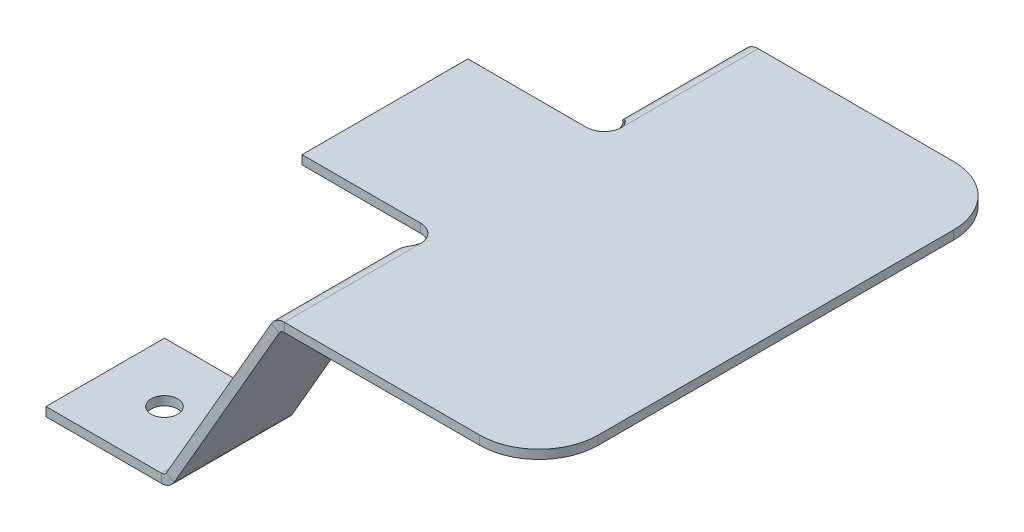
ISO-10303-21;
HEADER;
FILE_DESCRIPTION(('STEP AP214'),'2;1');
FILE_NAME('part.step','',(''),(''),'','','');
FILE_SCHEMA(('AUTOMOTIVE_DESIGN { 1 0 10303 214 1 1 1 1 }'));
ENDSEC;
DATA;
#1=APPLICATION_CONTEXT('core data for automotive mechanical design processes');
#2=APPLICATION_PROTOCOL_DEFINITION('international standard','automotive_design',2000,#1);
#3=PRODUCT_CONTEXT('',#1,'mechanical');
#4=PRODUCT('Part','Part','',(#3));
#5=PRODUCT_RELATED_PRODUCT_CATEGORY('part','',(#4));
#6=PRODUCT_DEFINITION_FORMATION('','',#4);
#7=PRODUCT_DEFINITION_CONTEXT('part definition',#1,'design');
#8=PRODUCT_DEFINITION('design','',#6,#7);
#9=PRODUCT_DEFINITION_SHAPE('','',#8);
#10=(LENGTH_UNIT() NAMED_UNIT(*) SI_UNIT(.MILLI.,.METRE.));
#11=(NAMED_UNIT(*) PLANE_ANGLE_UNIT() SI_UNIT($,.RADIAN.));
#12=(NAMED_UNIT(*) SI_UNIT($,.STERADIAN.) SOLID_ANGLE_UNIT());
#13=UNCERTAINTY_MEASURE_WITH_UNIT(LENGTH_MEASURE(1.E-05),#10,'distance_accuracy_value','');
#14=(GEOMETRIC_REPRESENTATION_CONTEXT(3) GLOBAL_UNCERTAINTY_ASSIGNED_CONTEXT((#13)) GLOBAL_UNIT_ASSIGNED_CONTEXT((#10,
#11,#12)) REPRESENTATION_CONTEXT('',''));
#15=CARTESIAN_POINT('',(0.,0.,0.));
#16=DIRECTION('',(0.,0.,1.));
#17=DIRECTION('',(1.,0.,0.));
#18=AXIS2_PLACEMENT_3D('',#15,#16,#17);
#19=CARTESIAN_POINT('',(53.8585431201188,-1.44116292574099,-57.));
#20=DIRECTION('',(0.86602540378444,-0.499999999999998,0.));
#21=DIRECTION('',(0.,0.,-1.));
#22=AXIS2_PLACEMENT_3D('',#19,#20,#21);
#23=CYLINDRICAL_SURFACE('',#22,3.);
#24=CARTESIAN_POINT('',(55.1575812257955,-2.19116292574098,-57.));
#25=DIRECTION('',(0.86602540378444,-0.499999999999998,0.));
#26=DIRECTION('',(0.,0.,1.));
#27=AXIS2_PLACEMENT_3D('',#24,#25,#26);
#28=CIRCLE('',#27,3.);
#29=CARTESIAN_POINT('',(55.1575812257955,-2.19116292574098,-60.));
#30=VERTEX_POINT('',#29);
#31=CARTESIAN_POINT('',(56.1339745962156,-0.5,-59.2774160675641));
#32=VERTEX_POINT('',#31);
#33=EDGE_CURVE('E82',#30,#32,#28,.T.);
#34=ORIENTED_EDGE('',*,*,#33,.T.);
#35=CARTESIAN_POINT('',(54.8349364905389,0.250000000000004,-59.2774160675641));
#36=CARTESIAN_POINT('',(56.1339745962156,-0.499999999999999,-59.2774160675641));
#37=B_SPLINE_CURVE_WITH_KNOTS('',1,(#35,#36),.UNSPECIFIED.,.F.,.F.,(2,2),(0.,1.),.UNSPECIFIED.);
#38=CARTESIAN_POINT('',(54.8349364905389,0.250000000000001,-59.2774160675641));
#39=VERTEX_POINT('',#38);
#40=EDGE_CURVE('E301',#32,#39,#37,.F.);
#41=ORIENTED_EDGE('',*,*,#40,.T.);
#42=CARTESIAN_POINT('',(53.8585431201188,-1.44116292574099,-57.));
#43=DIRECTION('',(0.86602540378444,-0.499999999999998,0.));
#44=DIRECTION('',(0.,0.,1.));
#45=AXIS2_PLACEMENT_3D('',#42,#43,#44);
#46=CIRCLE('',#45,3.);
#47=CARTESIAN_POINT('',(53.8585431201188,-1.44116292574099,-60.));
#48=VERTEX_POINT('',#47);
#49=EDGE_CURVE('E880',#48,#39,#46,.T.);
#50=ORIENTED_EDGE('',*,*,#49,.F.);
#51=DIRECTION('',(0.86602540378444,-0.499999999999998,0.));
#52=VECTOR('',#51,1.);
#53=CARTESIAN_POINT('',(53.8585431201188,-1.44116292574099,-60.));
#54=LINE('',#53,#52);
#55=EDGE_CURVE('E884',#48,#30,#54,.T.);
#56=ORIENTED_EDGE('',*,*,#55,.T.);
#57=EDGE_LOOP('',(#34,#41,#50,#56));
#58=FACE_BOUND('',#57,.T.);
#59=ADVANCED_FACE('F58',(#58),#23,.F.);
#60=CARTESIAN_POINT('',(73.1575812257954,28.9857516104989,-10.));
#61=DIRECTION('',(-0.86602540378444,0.499999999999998,0.));
#62=DIRECTION('',(0.,0.,1.));
#63=AXIS2_PLACEMENT_3D('',#60,#61,#62);
#64=PLANE('',#63);
#65=DIRECTION('',(-0.499999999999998,-0.86602540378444,0.));
#66=VECTOR('',#65,1.);
#67=CARTESIAN_POINT('',(73.1575812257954,28.9857516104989,-80.));
#68=LINE('',#67,#66);
#69=CARTESIAN_POINT('',(56.1339745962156,-0.499999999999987,-80.));
#70=VERTEX_POINT('',#69);
#71=CARTESIAN_POINT('',(38.4193845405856,-31.1825700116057,-80.));
#72=VERTEX_POINT('',#71);
#73=EDGE_CURVE('E75',#70,#72,#68,.T.);
#74=ORIENTED_EDGE('',*,*,#73,.F.);
#75=DIRECTION('',(0.,0.,1.));
#76=VECTOR('',#75,1.);
#77=CARTESIAN_POINT('',(56.1339745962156,-0.5,-10.));
#78=LINE('',#77,#76);
#79=EDGE_CURVE('E67',#70,#32,#78,.T.);
#80=ORIENTED_EDGE('',*,*,#79,.T.);
#81=ORIENTED_EDGE('',*,*,#33,.F.);
#82=DIRECTION('',(0.499999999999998,0.86602540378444,0.));
#83=VECTOR('',#82,1.);
#84=CARTESIAN_POINT('',(28.1575812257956,-48.9565347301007,-60.));
#85=LINE('',#84,#83);
#86=CARTESIAN_POINT('',(38.4193845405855,-31.1825700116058,-60.));
#87=VERTEX_POINT('',#86);
#88=EDGE_CURVE('E873',#87,#30,#85,.T.);
#89=ORIENTED_EDGE('',*,*,#88,.F.);
#90=DIRECTION('',(0.,0.,-1.));
#91=VECTOR('',#90,1.);
#92=CARTESIAN_POINT('',(38.4193845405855,-31.1825700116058,-9.99999999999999));
#93=LINE('',#92,#91);
#94=EDGE_CURVE('E878',#87,#72,#93,.T.);
#95=ORIENTED_EDGE('',*,*,#94,.T.);
#96=EDGE_LOOP('',(#74,#80,#81,#89,#95));
#97=FACE_BOUND('',#96,.T.);
#98=ADVANCED_FACE('F60',(#97),#64,.F.);
#99=CARTESIAN_POINT('',(71.8585431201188,29.7357516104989,-80.));
#100=DIRECTION('',(0.,0.,1.));
#101=DIRECTION('',(0.499999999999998,0.86602540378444,0.));
#102=AXIS2_PLACEMENT_3D('',#99,#100,#101);
#103=PLANE('',#102);
#104=DIRECTION('',(-0.499999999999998,-0.86602540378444,0.));
#105=VECTOR('',#104,1.);
#106=CARTESIAN_POINT('',(71.8585431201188,29.7357516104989,-80.));
#107=LINE('',#106,#105);
#108=CARTESIAN_POINT('',(54.8349364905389,0.250000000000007,-80.));
#109=VERTEX_POINT('',#108);
#110=CARTESIAN_POINT('',(37.1203464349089,-30.4325700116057,-80.));
#111=VERTEX_POINT('',#110);
#112=EDGE_CURVE('E883',#109,#111,#107,.T.);
#113=ORIENTED_EDGE('',*,*,#112,.F.);
#114=DIRECTION('',(0.86602540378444,-0.499999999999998,0.));
#115=VECTOR('',#114,1.);
#116=CARTESIAN_POINT('',(54.8349364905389,0.249999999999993,-80.));
#117=LINE('',#116,#115);
#118=EDGE_CURVE('E12',#109,#70,#117,.T.);
#119=ORIENTED_EDGE('',*,*,#118,.T.);
#120=ORIENTED_EDGE('',*,*,#73,.T.);
#121=DIRECTION('',(-0.86602540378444,0.499999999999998,0.));
#122=VECTOR('',#121,1.);
#123=CARTESIAN_POINT('',(37.1203464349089,-30.4325700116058,-80.));
#124=LINE('',#123,#122);
#125=EDGE_CURVE('E869',#72,#111,#124,.T.);
#126=ORIENTED_EDGE('',*,*,#125,.T.);
#127=EDGE_LOOP('',(#113,#119,#120,#126));
#128=FACE_BOUND('',#127,.T.);
#129=ADVANCED_FACE('F751',(#128),#103,.F.);
#130=CARTESIAN_POINT('',(71.8585431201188,29.7357516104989,-10.));
#131=DIRECTION('',(-0.86602540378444,0.499999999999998,0.));
#132=DIRECTION('',(0.,0.,1.));
#133=AXIS2_PLACEMENT_3D('',#130,#131,#132);
#134=PLANE('',#133);
#135=DIRECTION('',(0.,0.,1.));
#136=VECTOR('',#135,1.);
#137=CARTESIAN_POINT('',(54.8349364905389,0.249999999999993,-10.));
#138=LINE('',#137,#136);
#139=EDGE_CURVE('E872',#109,#39,#138,.T.);
#140=ORIENTED_EDGE('',*,*,#139,.F.);
#141=ORIENTED_EDGE('',*,*,#112,.T.);
#142=DIRECTION('',(0.,0.,-1.));
#143=VECTOR('',#142,1.);
#144=CARTESIAN_POINT('',(37.1203464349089,-30.4325700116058,-9.99999999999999));
#145=LINE('',#144,#143);
#146=CARTESIAN_POINT('',(37.1203464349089,-30.4325700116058,-60.));
#147=VERTEX_POINT('',#146);
#148=EDGE_CURVE('E865',#147,#111,#145,.T.);
#149=ORIENTED_EDGE('',*,*,#148,.F.);
#150=DIRECTION('',(0.499999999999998,0.86602540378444,0.));
#151=VECTOR('',#150,1.);
#152=CARTESIAN_POINT('',(26.8585431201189,-48.2065347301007,-60.));
#153=LINE('',#152,#151);
#154=EDGE_CURVE('E881',#147,#48,#153,.T.);
#155=ORIENTED_EDGE('',*,*,#154,.T.);
#156=ORIENTED_EDGE('',*,*,#49,.T.);
#157=EDGE_LOOP('',(#140,#141,#149,#155,#156));
#158=FACE_BOUND('',#157,.T.);
#159=ADVANCED_FACE('F903',(#158),#134,.T.);
#160=CARTESIAN_POINT('',(26.8585431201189,-48.2065347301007,-60.));
#161=DIRECTION('',(0.,0.,-1.));
#162=DIRECTION('',(-0.499999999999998,-0.86602540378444,0.));
#163=AXIS2_PLACEMENT_3D('',#160,#161,#162);
#164=PLANE('',#163);
#165=ORIENTED_EDGE('',*,*,#154,.F.);
#166=DIRECTION('',(0.86602540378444,-0.499999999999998,0.));
#167=VECTOR('',#166,1.);
#168=CARTESIAN_POINT('',(37.1203464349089,-30.4325700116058,-60.));
#169=LINE('',#168,#167);
#170=EDGE_CURVE('E875',#147,#87,#169,.T.);
#171=ORIENTED_EDGE('',*,*,#170,.T.);
#172=ORIENTED_EDGE('',*,*,#88,.T.);
#173=ORIENTED_EDGE('',*,*,#55,.F.);
#174=EDGE_LOOP('',(#165,#171,#172,#173));
#175=FACE_BOUND('',#174,.T.);
#176=ADVANCED_FACE('F755',(#175),#164,.F.);
#177=CARTESIAN_POINT('',(36.2543210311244,-29.9325700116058,-60.));
#178=DIRECTION('',(0.,0.,-1.));
#179=DIRECTION('',(-0.499999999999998,-0.86602540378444,0.));
#180=AXIS2_PLACEMENT_3D('',#177,#178,#179);
#181=PLANE('',#180);
#182=DIRECTION('',(0.,-1.,0.));
#183=VECTOR('',#182,1.);
#184=CARTESIAN_POINT('',(36.2543210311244,-30.9325700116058,-60.));
#185=LINE('',#184,#183);
#186=CARTESIAN_POINT('',(36.2543210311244,-30.9325700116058,-60.));
#187=VERTEX_POINT('',#186);
#188=CARTESIAN_POINT('',(36.2543210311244,-32.4325700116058,-60.));
#189=VERTEX_POINT('',#188);
#190=EDGE_CURVE('E355',#187,#189,#185,.T.);
#191=ORIENTED_EDGE('',*,*,#190,.T.);
#192=CARTESIAN_POINT('',(36.2543210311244,-29.9325700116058,-60.));
#193=DIRECTION('',(0.,0.,1.));
#194=DIRECTION('',(0.499999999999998,0.86602540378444,0.));
#195=AXIS2_PLACEMENT_3D('',#192,#193,#194);
#196=CIRCLE('',#195,2.5);
#197=EDGE_CURVE('E824',#189,#87,#196,.T.);
#198=ORIENTED_EDGE('',*,*,#197,.T.);
#199=ORIENTED_EDGE('',*,*,#170,.F.);
#200=CARTESIAN_POINT('',(36.2543210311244,-29.9325700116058,-60.));
#201=DIRECTION('',(0.,0.,1.));
#202=DIRECTION('',(0.499999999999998,0.86602540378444,0.));
#203=AXIS2_PLACEMENT_3D('',#200,#201,#202);
#204=CIRCLE('',#203,1.);
#205=EDGE_CURVE('E858',#187,#147,#204,.T.);
#206=ORIENTED_EDGE('',*,*,#205,.F.);
#207=EDGE_LOOP('',(#191,#198,#199,#206));
#208=FACE_BOUND('',#207,.T.);
#209=ADVANCED_FACE('F913',(#208),#181,.F.);
#210=CARTESIAN_POINT('',(36.2543210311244,-29.9325700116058,-80.));
#211=DIRECTION('',(0.,0.,1.));
#212=DIRECTION('',(0.499999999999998,0.86602540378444,0.));
#213=AXIS2_PLACEMENT_3D('',#210,#211,#212);
#214=PLANE('',#213);
#215=CARTESIAN_POINT('',(36.2543210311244,-29.9325700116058,-80.));
#216=DIRECTION('',(0.,0.,1.));
#217=DIRECTION('',(0.499999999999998,0.86602540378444,0.));
#218=AXIS2_PLACEMENT_3D('',#215,#216,#217);
#219=CIRCLE('',#218,2.5);
#220=CARTESIAN_POINT('',(36.2543210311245,-32.4325700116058,-80.));
#221=VERTEX_POINT('',#220);
#222=EDGE_CURVE('E862',#72,#221,#219,.F.);
#223=ORIENTED_EDGE('',*,*,#222,.T.);
#224=DIRECTION('',(0.,1.,0.));
#225=VECTOR('',#224,1.);
#226=CARTESIAN_POINT('',(36.2543210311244,-30.9325700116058,-80.));
#227=LINE('',#226,#225);
#228=CARTESIAN_POINT('',(36.2543210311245,-30.9325700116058,-80.));
#229=VERTEX_POINT('',#228);
#230=EDGE_CURVE('E850',#221,#229,#227,.T.);
#231=ORIENTED_EDGE('',*,*,#230,.T.);
#232=CARTESIAN_POINT('',(36.2543210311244,-29.9325700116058,-80.));
#233=DIRECTION('',(0.,0.,-1.));
#234=DIRECTION('',(-0.499999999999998,-0.86602540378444,0.));
#235=AXIS2_PLACEMENT_3D('',#232,#233,#234);
#236=CIRCLE('',#235,1.);
#237=EDGE_CURVE('E861',#111,#229,#236,.T.);
#238=ORIENTED_EDGE('',*,*,#237,.F.);
#239=ORIENTED_EDGE('',*,*,#125,.F.);
#240=EDGE_LOOP('',(#223,#231,#238,#239));
#241=FACE_BOUND('',#240,.T.);
#242=ADVANCED_FACE('F929',(#241),#214,.F.);
#243=CARTESIAN_POINT('',(36.2543210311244,-29.9325700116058,-90.0834921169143));
#244=DIRECTION('',(0.,0.,1.));
#245=DIRECTION('',(0.499999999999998,0.86602540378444,0.));
#246=AXIS2_PLACEMENT_3D('',#243,#244,#245);
#247=CYLINDRICAL_SURFACE('',#246,1.);
#248=ORIENTED_EDGE('',*,*,#148,.T.);
#249=ORIENTED_EDGE('',*,*,#237,.T.);
#250=DIRECTION('',(0.,0.,-1.));
#251=VECTOR('',#250,1.);
#252=CARTESIAN_POINT('',(36.2543210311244,-30.9325700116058,-9.99999999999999));
#253=LINE('',#252,#251);
#254=EDGE_CURVE('E837',#187,#229,#253,.T.);
#255=ORIENTED_EDGE('',*,*,#254,.F.);
#256=ORIENTED_EDGE('',*,*,#205,.T.);
#257=EDGE_LOOP('',(#248,#249,#255,#256));
#258=FACE_BOUND('',#257,.T.);
#259=ADVANCED_FACE('F917',(#258),#247,.F.);
#260=CARTESIAN_POINT('',(36.2543210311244,-29.9325700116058,-90.0834921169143));
#261=DIRECTION('',(0.,0.,1.));
#262=DIRECTION('',(0.499999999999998,0.86602540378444,0.));
#263=AXIS2_PLACEMENT_3D('',#260,#261,#262);
#264=CYLINDRICAL_SURFACE('',#263,2.5);
#265=ORIENTED_EDGE('',*,*,#94,.F.);
#266=ORIENTED_EDGE('',*,*,#197,.F.);
#267=DIRECTION('',(0.,0.,-1.));
#268=VECTOR('',#267,1.);
#269=CARTESIAN_POINT('',(36.2543210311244,-32.4325700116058,-9.99999999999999));
#270=LINE('',#269,#268);
#271=EDGE_CURVE('E853',#189,#221,#270,.T.);
#272=ORIENTED_EDGE('',*,*,#271,.T.);
#273=ORIENTED_EDGE('',*,*,#222,.F.);
#274=EDGE_LOOP('',(#265,#266,#272,#273));
#275=FACE_BOUND('',#274,.T.);
#276=ADVANCED_FACE('F933',(#275),#264,.T.);
#277=CARTESIAN_POINT('',(16.7779276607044,-30.9325700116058,-80.));
#278=DIRECTION('',(1.,0.,0.));
#279=DIRECTION('',(0.,0.,-1.));
#280=AXIS2_PLACEMENT_3D('',#277,#278,#279);
#281=PLANE('',#280);
#282=DIRECTION('',(0.,0.,1.));
#283=VECTOR('',#282,1.);
#284=CARTESIAN_POINT('',(16.7779276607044,-32.4325700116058,-80.));
#285=LINE('',#284,#283);
#286=CARTESIAN_POINT('',(16.7779276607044,-32.4325700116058,-80.));
#287=VERTEX_POINT('',#286);
#288=CARTESIAN_POINT('',(16.7779276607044,-32.4325700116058,-60.));
#289=VERTEX_POINT('',#288);
#290=EDGE_CURVE('E848',#287,#289,#285,.T.);
#291=ORIENTED_EDGE('',*,*,#290,.T.);
#292=DIRECTION('',(0.,-1.,0.));
#293=VECTOR('',#292,1.);
#294=CARTESIAN_POINT('',(16.7779276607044,-30.9325700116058,-60.));
#295=LINE('',#294,#293);
#296=CARTESIAN_POINT('',(16.7779276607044,-30.9325700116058,-60.));
#297=VERTEX_POINT('',#296);
#298=EDGE_CURVE('E825',#297,#289,#295,.T.);
#299=ORIENTED_EDGE('',*,*,#298,.F.);
#300=DIRECTION('',(0.,0.,1.));
#301=VECTOR('',#300,1.);
#302=CARTESIAN_POINT('',(16.7779276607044,-30.9325700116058,-80.));
#303=LINE('',#302,#301);
#304=CARTESIAN_POINT('',(16.7779276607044,-30.9325700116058,-80.));
#305=VERTEX_POINT('',#304);
#306=EDGE_CURVE('E833',#305,#297,#303,.T.);
#307=ORIENTED_EDGE('',*,*,#306,.F.);
#308=DIRECTION('',(0.,-1.,0.));
#309=VECTOR('',#308,1.);
#310=CARTESIAN_POINT('',(16.7779276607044,-30.9325700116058,-80.));
#311=LINE('',#310,#309);
#312=EDGE_CURVE('E845',#305,#287,#311,.T.);
#313=ORIENTED_EDGE('',*,*,#312,.T.);
#314=EDGE_LOOP('',(#291,#299,#307,#313));
#315=FACE_BOUND('',#314,.T.);
#316=ADVANCED_FACE('F944',(#315),#281,.F.);
#317=CARTESIAN_POINT('',(26.7779276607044,-30.9325700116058,-70.));
#318=DIRECTION('',(0.,-1.,0.));
#319=DIRECTION('',(0.,0.,-1.));
#320=AXIS2_PLACEMENT_3D('',#317,#318,#319);
#321=CYLINDRICAL_SURFACE('',#320,2.25);
#322=CARTESIAN_POINT('',(26.7779276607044,-30.9325700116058,-70.));
#323=DIRECTION('',(0.,1.,0.));
#324=DIRECTION('',(0.,0.,1.));
#325=AXIS2_PLACEMENT_3D('',#322,#323,#324);
#326=CIRCLE('',#325,2.25);
#327=CARTESIAN_POINT('',(26.7779276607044,-30.9325700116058,-67.75));
#328=VERTEX_POINT('',#327);
#329=EDGE_CURVE('E842',#328,#328,#326,.T.);
#330=ORIENTED_EDGE('',*,*,#329,.T.);
#331=EDGE_LOOP('',(#330));
#332=FACE_BOUND('',#331,.T.);
#333=CARTESIAN_POINT('',(26.7779276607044,-32.4325700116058,-70.));
#334=DIRECTION('',(0.,1.,0.));
#335=DIRECTION('',(0.,0.,1.));
#336=AXIS2_PLACEMENT_3D('',#333,#334,#335);
#337=CIRCLE('',#336,2.25);
#338=CARTESIAN_POINT('',(26.7779276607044,-32.4325700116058,-67.75));
#339=VERTEX_POINT('',#338);
#340=EDGE_CURVE('E828',#339,#339,#337,.T.);
#341=ORIENTED_EDGE('',*,*,#340,.F.);
#342=EDGE_LOOP('',(#341));
#343=FACE_BOUND('',#342,.T.);
#344=ADVANCED_FACE('F946',(#332,#343),#321,.F.);
#345=CARTESIAN_POINT('',(106.777927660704,-30.9325700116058,-10.));
#346=DIRECTION('',(0.,1.,0.));
#347=DIRECTION('',(0.,0.,1.));
#348=AXIS2_PLACEMENT_3D('',#345,#346,#347);
#349=PLANE('',#348);
#350=ORIENTED_EDGE('',*,*,#329,.F.);
#351=EDGE_LOOP('',(#350));
#352=FACE_BOUND('',#351,.T.);
#353=DIRECTION('',(1.,0.,0.));
#354=VECTOR('',#353,1.);
#355=CARTESIAN_POINT('',(16.7779276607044,-30.9325700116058,-60.));
#356=LINE('',#355,#354);
#357=EDGE_CURVE('E839',#297,#187,#356,.T.);
#358=ORIENTED_EDGE('',*,*,#357,.T.);
#359=ORIENTED_EDGE('',*,*,#254,.T.);
#360=DIRECTION('',(-1.,0.,0.));
#361=VECTOR('',#360,1.);
#362=CARTESIAN_POINT('',(106.777927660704,-30.9325700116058,-80.));
#363=LINE('',#362,#361);
#364=EDGE_CURVE('E835',#229,#305,#363,.T.);
#365=ORIENTED_EDGE('',*,*,#364,.T.);
#366=ORIENTED_EDGE('',*,*,#306,.T.);
#367=EDGE_LOOP('',(#358,#359,#365,#366));
#368=FACE_BOUND('',#367,.T.);
#369=ADVANCED_FACE('F921',(#352,#368),#349,.T.);
#370=CARTESIAN_POINT('',(106.777927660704,-30.9325700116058,-80.));
#371=DIRECTION('',(0.,0.,1.));
#372=DIRECTION('',(1.,0.,0.));
#373=AXIS2_PLACEMENT_3D('',#370,#371,#372);
#374=PLANE('',#373);
#375=ORIENTED_EDGE('',*,*,#230,.F.);
#376=DIRECTION('',(-1.,0.,0.));
#377=VECTOR('',#376,1.);
#378=CARTESIAN_POINT('',(106.777927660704,-32.4325700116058,-80.));
#379=LINE('',#378,#377);
#380=EDGE_CURVE('E831',#221,#287,#379,.T.);
#381=ORIENTED_EDGE('',*,*,#380,.T.);
#382=ORIENTED_EDGE('',*,*,#312,.F.);
#383=ORIENTED_EDGE('',*,*,#364,.F.);
#384=EDGE_LOOP('',(#375,#381,#382,#383));
#385=FACE_BOUND('',#384,.T.);
#386=ADVANCED_FACE('F926',(#385),#374,.F.);
#387=CARTESIAN_POINT('',(106.777927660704,-32.4325700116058,-10.));
#388=DIRECTION('',(0.,1.,0.));
#389=DIRECTION('',(0.,0.,1.));
#390=AXIS2_PLACEMENT_3D('',#387,#388,#389);
#391=PLANE('',#390);
#392=ORIENTED_EDGE('',*,*,#271,.F.);
#393=DIRECTION('',(1.,0.,0.));
#394=VECTOR('',#393,1.);
#395=CARTESIAN_POINT('',(16.7779276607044,-32.4325700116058,-60.));
#396=LINE('',#395,#394);
#397=EDGE_CURVE('E822',#289,#189,#396,.T.);
#398=ORIENTED_EDGE('',*,*,#397,.F.);
#399=ORIENTED_EDGE('',*,*,#290,.F.);
#400=ORIENTED_EDGE('',*,*,#380,.F.);
#401=EDGE_LOOP('',(#392,#398,#399,#400));
#402=FACE_BOUND('',#401,.T.);
#403=ORIENTED_EDGE('',*,*,#340,.T.);
#404=EDGE_LOOP('',(#403));
#405=FACE_BOUND('',#404,.T.);
#406=ADVANCED_FACE('F937',(#402,#405),#391,.F.);
#407=CARTESIAN_POINT('',(16.7779276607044,-30.9325700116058,-60.));
#408=DIRECTION('',(0.,0.,-1.));
#409=DIRECTION('',(-1.,0.,0.));
#410=AXIS2_PLACEMENT_3D('',#407,#408,#409);
#411=PLANE('',#410);
#412=ORIENTED_EDGE('',*,*,#190,.F.);
#413=ORIENTED_EDGE('',*,*,#357,.F.);
#414=ORIENTED_EDGE('',*,*,#298,.T.);
#415=ORIENTED_EDGE('',*,*,#397,.T.);
#416=EDGE_LOOP('',(#412,#413,#414,#415));
#417=FACE_BOUND('',#416,.T.);
#418=ADVANCED_FACE('F941',(#417),#411,.F.);
#419=CARTESIAN_POINT('',(90.,1.5,-70.));
#420=DIRECTION('',(0.,-1.,0.));
#421=DIRECTION('',(0.,0.,-1.));
#422=AXIS2_PLACEMENT_3D('',#419,#420,#421);
#423=CYLINDRICAL_SURFACE('',#422,10.);
#424=CARTESIAN_POINT('',(90.,0.,-70.));
#425=DIRECTION('',(0.,1.,0.));
#426=DIRECTION('',(0.,0.,1.));
#427=AXIS2_PLACEMENT_3D('',#424,#425,#426);
#428=CIRCLE('',#427,10.);
#429=CARTESIAN_POINT('',(100.,0.,-70.));
#430=VERTEX_POINT('',#429);
#431=CARTESIAN_POINT('',(90.,0.,-80.));
#432=VERTEX_POINT('',#431);
#433=EDGE_CURVE('E295',#430,#432,#428,.T.);
#434=ORIENTED_EDGE('',*,*,#433,.T.);
#435=DIRECTION('',(0.,-1.,0.));
#436=VECTOR('',#435,1.);
#437=CARTESIAN_POINT('',(90.,1.5,-80.));
#438=LINE('',#437,#436);
#439=CARTESIAN_POINT('',(90.,1.5,-80.));
#440=VERTEX_POINT('',#439);
#441=EDGE_CURVE('E361',#440,#432,#438,.T.);
#442=ORIENTED_EDGE('',*,*,#441,.F.);
#443=CARTESIAN_POINT('',(90.,1.5,-70.));
#444=DIRECTION('',(0.,1.,0.));
#445=DIRECTION('',(0.,0.,1.));
#446=AXIS2_PLACEMENT_3D('',#443,#444,#445);
#447=CIRCLE('',#446,10.);
#448=CARTESIAN_POINT('',(100.,1.5,-70.));
#449=VERTEX_POINT('',#448);
#450=EDGE_CURVE('E367',#449,#440,#447,.T.);
#451=ORIENTED_EDGE('',*,*,#450,.F.);
#452=DIRECTION('',(0.,-1.,0.));
#453=VECTOR('',#452,1.);
#454=CARTESIAN_POINT('',(100.,1.5,-70.));
#455=LINE('',#454,#453);
#456=EDGE_CURVE('E385',#449,#430,#455,.T.);
#457=ORIENTED_EDGE('',*,*,#456,.T.);
#458=EDGE_LOOP('',(#434,#442,#451,#457));
#459=FACE_BOUND('',#458,.T.);
#460=ADVANCED_FACE('F794',(#459),#423,.T.);
#461=CARTESIAN_POINT('',(100.,1.5,-10.));
#462=DIRECTION('',(-1.,0.,0.));
#463=DIRECTION('',(0.,0.,1.));
#464=AXIS2_PLACEMENT_3D('',#461,#462,#463);
#465=PLANE('',#464);
#466=DIRECTION('',(0.,0.,-1.));
#467=VECTOR('',#466,1.);
#468=CARTESIAN_POINT('',(100.,0.,-10.));
#469=LINE('',#468,#467);
#470=CARTESIAN_POINT('',(100.,0.,-10.));
#471=VERTEX_POINT('',#470);
#472=EDGE_CURVE('E383',#471,#430,#469,.T.);
#473=ORIENTED_EDGE('',*,*,#472,.T.);
#474=ORIENTED_EDGE('',*,*,#456,.F.);
#475=DIRECTION('',(0.,0.,-1.));
#476=VECTOR('',#475,1.);
#477=CARTESIAN_POINT('',(100.,1.5,-10.));
#478=LINE('',#477,#476);
#479=CARTESIAN_POINT('',(100.,1.5,-10.));
#480=VERTEX_POINT('',#479);
#481=EDGE_CURVE('E369',#480,#449,#478,.T.);
#482=ORIENTED_EDGE('',*,*,#481,.F.);
#483=DIRECTION('',(0.,-1.,0.));
#484=VECTOR('',#483,1.);
#485=CARTESIAN_POINT('',(100.,1.5,-10.));
#486=LINE('',#485,#484);
#487=EDGE_CURVE('E380',#480,#471,#486,.T.);
#488=ORIENTED_EDGE('',*,*,#487,.T.);
#489=EDGE_LOOP('',(#473,#474,#482,#488));
#490=FACE_BOUND('',#489,.T.);
#491=ADVANCED_FACE('F790',(#490),#465,.F.);
#492=CARTESIAN_POINT('',(90.,1.5,-10.));
#493=DIRECTION('',(0.,-1.,0.));
#494=DIRECTION('',(0.,0.,-1.));
#495=AXIS2_PLACEMENT_3D('',#492,#493,#494);
#496=CYLINDRICAL_SURFACE('',#495,10.);
#497=CARTESIAN_POINT('',(90.,0.,-10.));
#498=DIRECTION('',(0.,1.,0.));
#499=DIRECTION('',(0.,0.,1.));
#500=AXIS2_PLACEMENT_3D('',#497,#498,#499);
#501=CIRCLE('',#500,10.);
#502=CARTESIAN_POINT('',(90.,0.,0.));
#503=VERTEX_POINT('',#502);
#504=EDGE_CURVE('E378',#503,#471,#501,.T.);
#505=ORIENTED_EDGE('',*,*,#504,.T.);
#506=ORIENTED_EDGE('',*,*,#487,.F.);
#507=CARTESIAN_POINT('',(90.,1.5,-10.));
#508=DIRECTION('',(0.,1.,0.));
#509=DIRECTION('',(0.,0.,1.));
#510=AXIS2_PLACEMENT_3D('',#507,#508,#509);
#511=CIRCLE('',#510,10.);
#512=CARTESIAN_POINT('',(90.,1.5,0.));
#513=VERTEX_POINT('',#512);
#514=EDGE_CURVE('E371',#513,#480,#511,.T.);
#515=ORIENTED_EDGE('',*,*,#514,.F.);
#516=DIRECTION('',(0.,-1.,0.));
#517=VECTOR('',#516,1.);
#518=CARTESIAN_POINT('',(90.,1.5,0.));
#519=LINE('',#518,#517);
#520=EDGE_CURVE('E375',#513,#503,#519,.T.);
#521=ORIENTED_EDGE('',*,*,#520,.T.);
#522=EDGE_LOOP('',(#505,#506,#515,#521));
#523=FACE_BOUND('',#522,.T.);
#524=ADVANCED_FACE('F784',(#523),#496,.T.);
#525=CARTESIAN_POINT('',(90.,1.5,-10.));
#526=DIRECTION('',(0.,1.,0.));
#527=DIRECTION('',(0.,0.,1.));
#528=AXIS2_PLACEMENT_3D('',#525,#526,#527);
#529=PLANE('',#528);
#530=DIRECTION('',(0.,0.,-1.));
#531=VECTOR('',#530,1.);
#532=CARTESIAN_POINT('',(57.,1.5,-9.99999999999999));
#533=LINE('',#532,#531);
#534=CARTESIAN_POINT('',(57.,1.5,0.));
#535=VERTEX_POINT('',#534);
#536=CARTESIAN_POINT('',(57.,1.5,-23.));
#537=VERTEX_POINT('',#536);
#538=EDGE_CURVE('E397',#535,#537,#533,.T.);
#539=ORIENTED_EDGE('',*,*,#538,.F.);
#540=DIRECTION('',(1.,0.,0.));
#541=VECTOR('',#540,1.);
#542=CARTESIAN_POINT('',(0.,1.5,0.));
#543=LINE('',#542,#541);
#544=EDGE_CURVE('E373',#535,#513,#543,.T.);
#545=ORIENTED_EDGE('',*,*,#544,.T.);
#546=ORIENTED_EDGE('',*,*,#514,.T.);
#547=ORIENTED_EDGE('',*,*,#481,.T.);
#548=ORIENTED_EDGE('',*,*,#450,.T.);
#549=DIRECTION('',(-1.,0.,0.));
#550=VECTOR('',#549,1.);
#551=CARTESIAN_POINT('',(90.,1.5,-80.));
#552=LINE('',#551,#550);
#553=CARTESIAN_POINT('',(57.,1.5,-80.));
#554=VERTEX_POINT('',#553);
#555=EDGE_CURVE('E364',#440,#554,#552,.T.);
#556=ORIENTED_EDGE('',*,*,#555,.T.);
#557=DIRECTION('',(0.,0.,1.));
#558=VECTOR('',#557,1.);
#559=CARTESIAN_POINT('',(57.,1.5,-10.));
#560=LINE('',#559,#558);
#561=CARTESIAN_POINT('',(57.,1.5,-57.));
#562=VERTEX_POINT('',#561);
#563=EDGE_CURVE('E270',#554,#562,#560,.T.);
#564=ORIENTED_EDGE('',*,*,#563,.T.);
#565=CARTESIAN_POINT('',(54.,1.5,-57.));
#566=DIRECTION('',(0.,-1.,0.));
#567=DIRECTION('',(0.,0.,1.));
#568=AXIS2_PLACEMENT_3D('',#565,#566,#567);
#569=CIRCLE('',#568,2.99999999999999);
#570=CARTESIAN_POINT('',(54.,1.5,-54.));
#571=VERTEX_POINT('',#570);
#572=EDGE_CURVE('E263',#562,#571,#569,.T.);
#573=ORIENTED_EDGE('',*,*,#572,.T.);
#574=DIRECTION('',(-1.,0.,0.));
#575=VECTOR('',#574,1.);
#576=CARTESIAN_POINT('',(54.,1.5,-54.));
#577=LINE('',#576,#575);
#578=CARTESIAN_POINT('',(34.,1.5,-54.));
#579=VERTEX_POINT('',#578);
#580=EDGE_CURVE('E660',#571,#579,#577,.T.);
#581=ORIENTED_EDGE('',*,*,#580,.T.);
#582=DIRECTION('',(0.,0.,1.));
#583=VECTOR('',#582,1.);
#584=CARTESIAN_POINT('',(34.,1.5,-54.));
#585=LINE('',#584,#583);
#586=CARTESIAN_POINT('',(34.,1.5,-26.));
#587=VERTEX_POINT('',#586);
#588=EDGE_CURVE('E657',#579,#587,#585,.T.);
#589=ORIENTED_EDGE('',*,*,#588,.T.);
#590=DIRECTION('',(1.,0.,0.));
#591=VECTOR('',#590,1.);
#592=CARTESIAN_POINT('',(34.,1.5,-26.));
#593=LINE('',#592,#591);
#594=CARTESIAN_POINT('',(54.,1.5,-26.));
#595=VERTEX_POINT('',#594);
#596=EDGE_CURVE('E654',#587,#595,#593,.T.);
#597=ORIENTED_EDGE('',*,*,#596,.T.);
#598=CARTESIAN_POINT('',(54.,1.5,-23.));
#599=DIRECTION('',(0.,-1.,0.));
#600=DIRECTION('',(0.,0.,1.));
#601=AXIS2_PLACEMENT_3D('',#598,#599,#600);
#602=CIRCLE('',#601,2.99999999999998);
#603=EDGE_CURVE('E674',#595,#537,#602,.T.);
#604=ORIENTED_EDGE('',*,*,#603,.T.);
#605=EDGE_LOOP('',(#539,#545,#546,#547,#548,#556,#564,#573,#581,#589,#597,#604));
#606=FACE_BOUND('',#605,.T.);
#607=ADVANCED_FACE('F673',(#606),#529,.T.);
#608=CARTESIAN_POINT('',(90.,0.,-10.));
#609=DIRECTION('',(0.,1.,0.));
#610=DIRECTION('',(0.,0.,1.));
#611=AXIS2_PLACEMENT_3D('',#608,#609,#610);
#612=PLANE('',#611);
#613=DIRECTION('',(1.,0.,0.));
#614=VECTOR('',#613,1.);
#615=CARTESIAN_POINT('',(0.,0.,0.));
#616=LINE('',#615,#614);
#617=CARTESIAN_POINT('',(57.,0.,0.));
#618=VERTEX_POINT('',#617);
#619=EDGE_CURVE('E348',#618,#503,#616,.T.);
#620=ORIENTED_EDGE('',*,*,#619,.F.);
#621=DIRECTION('',(0.,0.,-1.));
#622=VECTOR('',#621,1.);
#623=CARTESIAN_POINT('',(57.,0.,-9.99999999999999));
#624=LINE('',#623,#622);
#625=CARTESIAN_POINT('',(57.,0.,-23.));
#626=VERTEX_POINT('',#625);
#627=EDGE_CURVE('E269',#618,#626,#624,.T.);
#628=ORIENTED_EDGE('',*,*,#627,.T.);
#629=CARTESIAN_POINT('',(54.,0.,-23.));
#630=DIRECTION('',(0.,-1.,0.));
#631=DIRECTION('',(0.,0.,1.));
#632=AXIS2_PLACEMENT_3D('',#629,#630,#631);
#633=CIRCLE('',#632,2.99999999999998);
#634=CARTESIAN_POINT('',(54.,0.,-26.));
#635=VERTEX_POINT('',#634);
#636=EDGE_CURVE('E284',#635,#626,#633,.T.);
#637=ORIENTED_EDGE('',*,*,#636,.F.);
#638=DIRECTION('',(1.,0.,0.));
#639=VECTOR('',#638,1.);
#640=CARTESIAN_POINT('',(34.,0.,-26.));
#641=LINE('',#640,#639);
#642=CARTESIAN_POINT('',(34.,0.,-26.));
#643=VERTEX_POINT('',#642);
#644=EDGE_CURVE('E649',#643,#635,#641,.T.);
#645=ORIENTED_EDGE('',*,*,#644,.F.);
#646=DIRECTION('',(0.,0.,1.));
#647=VECTOR('',#646,1.);
#648=CARTESIAN_POINT('',(34.,0.,-54.));
#649=LINE('',#648,#647);
#650=CARTESIAN_POINT('',(34.,0.,-54.));
#651=VERTEX_POINT('',#650);
#652=EDGE_CURVE('E665',#651,#643,#649,.T.);
#653=ORIENTED_EDGE('',*,*,#652,.F.);
#654=DIRECTION('',(-1.,0.,0.));
#655=VECTOR('',#654,1.);
#656=CARTESIAN_POINT('',(54.,0.,-54.));
#657=LINE('',#656,#655);
#658=CARTESIAN_POINT('',(54.,0.,-54.));
#659=VERTEX_POINT('',#658);
#660=EDGE_CURVE('E283',#659,#651,#657,.T.);
#661=ORIENTED_EDGE('',*,*,#660,.F.);
#662=CARTESIAN_POINT('',(54.,0.,-57.));
#663=DIRECTION('',(0.,-1.,0.));
#664=DIRECTION('',(0.,0.,1.));
#665=AXIS2_PLACEMENT_3D('',#662,#663,#664);
#666=CIRCLE('',#665,2.99999999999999);
#667=CARTESIAN_POINT('',(57.,0.,-57.));
#668=VERTEX_POINT('',#667);
#669=EDGE_CURVE('E261',#668,#659,#666,.T.);
#670=ORIENTED_EDGE('',*,*,#669,.F.);
#671=DIRECTION('',(0.,0.,1.));
#672=VECTOR('',#671,1.);
#673=CARTESIAN_POINT('',(57.,0.,-10.));
#674=LINE('',#673,#672);
#675=CARTESIAN_POINT('',(57.,0.,-80.));
#676=VERTEX_POINT('',#675);
#677=EDGE_CURVE('E280',#676,#668,#674,.T.);
#678=ORIENTED_EDGE('',*,*,#677,.F.);
#679=DIRECTION('',(-1.,0.,0.));
#680=VECTOR('',#679,1.);
#681=CARTESIAN_POINT('',(90.,0.,-80.));
#682=LINE('',#681,#680);
#683=EDGE_CURVE('E359',#432,#676,#682,.T.);
#684=ORIENTED_EDGE('',*,*,#683,.F.);
#685=ORIENTED_EDGE('',*,*,#433,.F.);
#686=ORIENTED_EDGE('',*,*,#472,.F.);
#687=ORIENTED_EDGE('',*,*,#504,.F.);
#688=EDGE_LOOP('',(#620,#628,#637,#645,#653,#661,#670,#678,#684,#685,#686,#687));
#689=FACE_BOUND('',#688,.T.);
#690=ADVANCED_FACE('F278',(#689),#612,.F.);
#691=CARTESIAN_POINT('',(90.,1.5,-80.));
#692=DIRECTION('',(0.,0.,1.));
#693=DIRECTION('',(1.,0.,0.));
#694=AXIS2_PLACEMENT_3D('',#691,#692,#693);
#695=PLANE('',#694);
#696=DIRECTION('',(0.,-1.,0.));
#697=VECTOR('',#696,1.);
#698=CARTESIAN_POINT('',(57.,1.5,-80.));
#699=LINE('',#698,#697);
#700=EDGE_CURVE('E296',#554,#676,#699,.T.);
#701=ORIENTED_EDGE('',*,*,#700,.F.);
#702=ORIENTED_EDGE('',*,*,#555,.F.);
#703=ORIENTED_EDGE('',*,*,#441,.T.);
#704=ORIENTED_EDGE('',*,*,#683,.T.);
#705=EDGE_LOOP('',(#701,#702,#703,#704));
#706=FACE_BOUND('',#705,.T.);
#707=ADVANCED_FACE('F798',(#706),#695,.F.);
#708=CARTESIAN_POINT('',(0.,1.5,0.));
#709=DIRECTION('',(0.,0.,-1.));
#710=DIRECTION('',(-1.,0.,0.));
#711=AXIS2_PLACEMENT_3D('',#708,#709,#710);
#712=PLANE('',#711);
#713=ORIENTED_EDGE('',*,*,#544,.F.);
#714=DIRECTION('',(0.,-1.,0.));
#715=VECTOR('',#714,1.);
#716=CARTESIAN_POINT('',(57.,1.5,0.));
#717=LINE('',#716,#715);
#718=EDGE_CURVE('E356',#535,#618,#717,.T.);
#719=ORIENTED_EDGE('',*,*,#718,.T.);
#720=ORIENTED_EDGE('',*,*,#619,.T.);
#721=ORIENTED_EDGE('',*,*,#520,.F.);
#722=EDGE_LOOP('',(#713,#719,#720,#721));
#723=FACE_BOUND('',#722,.T.);
#724=ADVANCED_FACE('F779',(#723),#712,.F.);
#725=CARTESIAN_POINT('',(57.,-1.,-80.));
#726=DIRECTION('',(0.,0.,-1.));
#727=DIRECTION('',(-1.,0.,0.));
#728=AXIS2_PLACEMENT_3D('',#725,#726,#727);
#729=PLANE('',#728);
#730=ORIENTED_EDGE('',*,*,#700,.T.);
#731=CARTESIAN_POINT('',(57.,-1.,-80.));
#732=DIRECTION('',(0.,0.,1.));
#733=DIRECTION('',(1.,0.,0.));
#734=AXIS2_PLACEMENT_3D('',#731,#732,#733);
#735=CIRCLE('',#734,1.);
#736=EDGE_CURVE('E293',#676,#70,#735,.T.);
#737=ORIENTED_EDGE('',*,*,#736,.T.);
#738=ORIENTED_EDGE('',*,*,#118,.F.);
#739=CARTESIAN_POINT('',(57.,-1.,-80.));
#740=DIRECTION('',(0.,0.,1.));
#741=DIRECTION('',(1.,0.,0.));
#742=AXIS2_PLACEMENT_3D('',#739,#740,#741);
#743=CIRCLE('',#742,2.5);
#744=EDGE_CURVE('E303',#554,#109,#743,.T.);
#745=ORIENTED_EDGE('',*,*,#744,.F.);
#746=EDGE_LOOP('',(#730,#737,#738,#745));
#747=FACE_BOUND('',#746,.T.);
#748=ADVANCED_FACE('F325',(#747),#729,.T.);
#749=CARTESIAN_POINT('',(54.8349364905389,0.250000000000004,-59.2774160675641));
#750=CARTESIAN_POINT('',(55.034831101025,0.596227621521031,-59.1183732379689));
#751=CARTESIAN_POINT('',(55.2805247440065,0.835508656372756,-58.9728306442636));
#752=CARTESIAN_POINT('',(55.6107433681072,1.08299971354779,-58.7720528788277));
#753=CARTESIAN_POINT('',(55.7150925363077,1.14718697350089,-58.7082004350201));
#754=CARTESIAN_POINT('',(55.85589955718,1.22348464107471,-58.6170319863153));
#755=CARTESIAN_POINT('',(55.9002558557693,1.24558455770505,-58.5874108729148));
#756=CARTESIAN_POINT('',(55.9623407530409,1.2745955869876,-58.5441317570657));
#757=CARTESIAN_POINT('',(55.9822960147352,1.28357530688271,-58.5298974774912));
#758=CARTESIAN_POINT('',(56.0110622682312,1.29610791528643,-58.5088341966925));
#759=CARTESIAN_POINT('',(56.0204566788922,1.30012922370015,-58.5018611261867));
#760=CARTESIAN_POINT('',(56.0342504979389,1.30593859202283,-58.4914735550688));
#761=CARTESIAN_POINT('',(56.0387988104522,1.30783794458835,-58.4880230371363));
#762=CARTESIAN_POINT('',(56.045546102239,1.31063274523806,-58.4828652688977));
#763=CARTESIAN_POINT('',(56.0477826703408,1.3115553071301,-58.4811490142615));
#764=CARTESIAN_POINT('',(56.0511186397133,1.31292576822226,-58.4785791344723));
#765=CARTESIAN_POINT('',(56.0522274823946,1.31338035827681,-58.4777232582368));
#766=CARTESIAN_POINT('',(56.054438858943,1.31428510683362,-58.4760130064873));
#767=CARTESIAN_POINT('',(56.0545234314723,1.31432048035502,-58.4759490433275));
#768=CARTESIAN_POINT('',(56.3276594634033,1.4256142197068,-58.2638682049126));
#769=CARTESIAN_POINT('',(56.553958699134,1.46516506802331,-58.0357910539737));
#770=CARTESIAN_POINT('',(56.8742821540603,1.50203650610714,-57.5443560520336));
#771=CARTESIAN_POINT('',(56.970217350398,1.5,-57.2809766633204));
#772=CARTESIAN_POINT('',(57.,1.5,-57.));
#773=CARTESIAN_POINT('',(56.1339745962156,-0.499999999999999,-59.2774160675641));
#774=CARTESIAN_POINT('',(56.2138057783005,-0.361728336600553,-59.1186251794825));
#775=CARTESIAN_POINT('',(56.3122098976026,-0.265796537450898,-58.9728306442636));
#776=CARTESIAN_POINT('',(56.4442973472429,-0.166800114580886,-58.7720528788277));
#777=CARTESIAN_POINT('',(56.4860370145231,-0.141125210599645,-58.7082004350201));
#778=CARTESIAN_POINT('',(56.542359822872,-0.110606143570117,-58.6170319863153));
#779=CARTESIAN_POINT('',(56.5601023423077,-0.101766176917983,-58.5874108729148));
#780=CARTESIAN_POINT('',(56.5849363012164,-0.0901617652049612,-58.5441317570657));
#781=CARTESIAN_POINT('',(56.5929184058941,-0.0865698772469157,-58.5298974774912));
#782=CARTESIAN_POINT('',(56.6044249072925,-0.0815568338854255,-58.5088341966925));
#783=CARTESIAN_POINT('',(56.6081826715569,-0.0799483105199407,-58.5018611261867));
#784=CARTESIAN_POINT('',(56.6137001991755,-0.0776245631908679,-58.4914735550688));
#785=CARTESIAN_POINT('',(56.6155195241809,-0.0768648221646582,-58.4880230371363));
#786=CARTESIAN_POINT('',(56.6182184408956,-0.0757469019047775,-58.4828652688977));
#787=CARTESIAN_POINT('',(56.6191130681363,-0.0753778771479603,-58.4811490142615));
#788=CARTESIAN_POINT('',(56.6204474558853,-0.0748296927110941,-58.4785791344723));
#789=CARTESIAN_POINT('',(56.6208909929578,-0.0746478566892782,-58.4777232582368));
#790=CARTESIAN_POINT('',(56.6217755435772,-0.0742859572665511,-58.4760130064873));
#791=CARTESIAN_POINT('',(56.6218093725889,-0.0742718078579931,-58.4759490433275));
#792=CARTESIAN_POINT('',(56.7310637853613,-0.0297543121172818,-58.2638682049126));
#793=CARTESIAN_POINT('',(56.8215834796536,-0.0139339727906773,-58.0357910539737));
#794=CARTESIAN_POINT('',(56.9497128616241,0.000814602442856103,-57.5443560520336));
#795=CARTESIAN_POINT('',(56.9880861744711,0.,-57.2809947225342));
#796=CARTESIAN_POINT('',(57.,0.,-57.));
#797=B_SPLINE_SURFACE_WITH_KNOTS('',1,3,((#749,#750,#751,#752,#753,#754,#755,#756,#757,#758,
#759,#760,#761,#762,#763,#764,#765,#766,#767,#768,#769,#770,#771,#772),(#773,#774,#775,#776,
#777,#778,#779,#780,#781,#782,#783,#784,#785,#786,#787,#788,#789,#790,#791,#792,#793,#794,#795,
#796)),.UNSPECIFIED.,.F.,.F.,.F.,(2,2),(4,2,2,2,2,2,2,2,2,2,2,4),(0.,1.),(0.,0.25,0.375,0.4375,
0.46875,0.484375,0.4921875,0.49609375,0.498046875,0.5,0.75,1.),.UNSPECIFIED.);
#798=CARTESIAN_POINT('',(56.1339745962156,-0.499999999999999,-59.2774160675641));
#799=CARTESIAN_POINT('',(56.2138057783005,-0.361728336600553,-59.1186251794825));
#800=CARTESIAN_POINT('',(56.3122098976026,-0.265796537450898,-58.9728306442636));
#801=CARTESIAN_POINT('',(56.4442973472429,-0.166800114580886,-58.7720528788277));
#802=CARTESIAN_POINT('',(56.4860370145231,-0.141125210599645,-58.7082004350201));
#803=CARTESIAN_POINT('',(56.542359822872,-0.110606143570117,-58.6170319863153));
#804=CARTESIAN_POINT('',(56.5601023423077,-0.101766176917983,-58.5874108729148));
#805=CARTESIAN_POINT('',(56.5849363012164,-0.0901617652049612,-58.5441317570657));
#806=CARTESIAN_POINT('',(56.5929184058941,-0.0865698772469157,-58.5298974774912));
#807=CARTESIAN_POINT('',(56.6044249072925,-0.0815568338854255,-58.5088341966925));
#808=CARTESIAN_POINT('',(56.6081826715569,-0.0799483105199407,-58.5018611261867));
#809=CARTESIAN_POINT('',(56.6137001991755,-0.0776245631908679,-58.4914735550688));
#810=CARTESIAN_POINT('',(56.6155195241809,-0.0768648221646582,-58.4880230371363));
#811=CARTESIAN_POINT('',(56.6182184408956,-0.0757469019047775,-58.4828652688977));
#812=CARTESIAN_POINT('',(56.6191130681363,-0.0753778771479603,-58.4811490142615));
#813=CARTESIAN_POINT('',(56.6204474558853,-0.0748296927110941,-58.4785791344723));
#814=CARTESIAN_POINT('',(56.6208909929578,-0.0746478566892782,-58.4777232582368));
#815=CARTESIAN_POINT('',(56.6217755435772,-0.0742859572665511,-58.4760130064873));
#816=CARTESIAN_POINT('',(56.6218093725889,-0.0742718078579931,-58.4759490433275));
#817=CARTESIAN_POINT('',(56.7310637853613,-0.0297543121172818,-58.2638682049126));
#818=CARTESIAN_POINT('',(56.8215834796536,-0.0139339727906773,-58.0357910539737));
#819=CARTESIAN_POINT('',(56.9497128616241,0.000814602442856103,-57.5443560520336));
#820=CARTESIAN_POINT('',(56.9880861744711,0.,-57.2809947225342));
#821=CARTESIAN_POINT('',(57.,0.,-57.));
#822=B_SPLINE_CURVE_WITH_KNOTS('',3,(#798,#799,#800,#801,#802,#803,#804,#805,#806,#807,#808,
#809,#810,#811,#812,#813,#814,#815,#816,#817,#818,#819,#820,#821),.UNSPECIFIED.,.F.,.F.,(4,2,2,
2,2,2,2,2,2,2,2,4),(0.,0.25,0.375,0.4375,0.46875,0.484375,0.4921875,0.49609375,0.498046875,0.5,
0.75,1.),.UNSPECIFIED.);
#823=EDGE_CURVE('E290',#32,#668,#822,.T.);
#824=CARTESIAN_POINT('',(57.,0.,-57.));
#825=CARTESIAN_POINT('',(57.,1.5,-57.));
#826=B_SPLINE_CURVE_WITH_KNOTS('',1,(#824,#825),.UNSPECIFIED.,.F.,.F.,(2,2),(0.,1.),.UNSPECIFIED.);
#827=EDGE_CURVE('E257',#668,#562,#826,.T.);
#828=CARTESIAN_POINT('',(57.,1.5,-57.));
#829=CARTESIAN_POINT('',(56.970217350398,1.5,-57.2809766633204));
#830=CARTESIAN_POINT('',(56.8742821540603,1.50203650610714,-57.5443560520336));
#831=CARTESIAN_POINT('',(56.553958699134,1.46516506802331,-58.0357910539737));
#832=CARTESIAN_POINT('',(56.3276594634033,1.4256142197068,-58.2638682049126));
#833=CARTESIAN_POINT('',(56.0545234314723,1.31432048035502,-58.4759490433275));
#834=CARTESIAN_POINT('',(56.054438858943,1.31428510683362,-58.4760130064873));
#835=CARTESIAN_POINT('',(56.0522274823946,1.31338035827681,-58.4777232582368));
#836=CARTESIAN_POINT('',(56.0511186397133,1.31292576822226,-58.4785791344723));
#837=CARTESIAN_POINT('',(56.0477826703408,1.3115553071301,-58.4811490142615));
#838=CARTESIAN_POINT('',(56.045546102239,1.31063274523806,-58.4828652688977));
#839=CARTESIAN_POINT('',(56.0387988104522,1.30783794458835,-58.4880230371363));
#840=CARTESIAN_POINT('',(56.0342504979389,1.30593859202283,-58.4914735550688));
#841=CARTESIAN_POINT('',(56.0204566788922,1.30012922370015,-58.5018611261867));
#842=CARTESIAN_POINT('',(56.0110622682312,1.29610791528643,-58.5088341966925));
#843=CARTESIAN_POINT('',(55.9822960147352,1.28357530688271,-58.5298974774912));
#844=CARTESIAN_POINT('',(55.9623407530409,1.2745955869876,-58.5441317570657));
#845=CARTESIAN_POINT('',(55.9002558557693,1.24558455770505,-58.5874108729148));
#846=CARTESIAN_POINT('',(55.85589955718,1.22348464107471,-58.6170319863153));
#847=CARTESIAN_POINT('',(55.7150925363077,1.14718697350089,-58.7082004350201));
#848=CARTESIAN_POINT('',(55.6107433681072,1.08299971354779,-58.7720528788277));
#849=CARTESIAN_POINT('',(55.2805247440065,0.835508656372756,-58.9728306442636));
#850=CARTESIAN_POINT('',(55.034831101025,0.596227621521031,-59.1183732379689));
#851=CARTESIAN_POINT('',(54.8349364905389,0.250000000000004,-59.2774160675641));
#852=B_SPLINE_CURVE_WITH_KNOTS('',3,(#828,#829,#830,#831,#832,#833,#834,#835,#836,#837,#838,
#839,#840,#841,#842,#843,#844,#845,#846,#847,#848,#849,#850,#851),.UNSPECIFIED.,.F.,.F.,(4,2,2,
2,2,2,2,2,2,2,2,4),(0.,0.25,0.5,0.501953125,0.50390625,0.5078125,0.515625,0.53125,0.5625,0.625,
0.75,1.),.UNSPECIFIED.);
#853=EDGE_CURVE('E400',#39,#562,#852,.F.);
#854=ORIENTED_EDGE('',*,*,#40,.F.);
#855=ORIENTED_EDGE('',*,*,#823,.T.);
#856=ORIENTED_EDGE('',*,*,#827,.T.);
#857=ORIENTED_EDGE('',*,*,#853,.F.);
#858=EDGE_LOOP('',(#854,#855,#856,#857));
#859=FACE_BOUND('',#858,.T.);
#860=ADVANCED_FACE('F300',(#859),#797,.T.);
#861=CARTESIAN_POINT('',(57.,-1.,-91.5726386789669));
#862=DIRECTION('',(0.,0.,1.));
#863=DIRECTION('',(1.,0.,0.));
#864=AXIS2_PLACEMENT_3D('',#861,#862,#863);
#865=CYLINDRICAL_SURFACE('',#864,2.5);
#866=ORIENTED_EDGE('',*,*,#853,.T.);
#867=ORIENTED_EDGE('',*,*,#563,.F.);
#868=ORIENTED_EDGE('',*,*,#744,.T.);
#869=ORIENTED_EDGE('',*,*,#139,.T.);
#870=EDGE_LOOP('',(#866,#867,#868,#869));
#871=FACE_BOUND('',#870,.T.);
#872=ADVANCED_FACE('F324',(#871),#865,.T.);
#873=CARTESIAN_POINT('',(57.,-1.,-91.5726386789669));
#874=DIRECTION('',(0.,0.,1.));
#875=DIRECTION('',(1.,0.,0.));
#876=AXIS2_PLACEMENT_3D('',#873,#874,#875);
#877=CYLINDRICAL_SURFACE('',#876,1.);
#878=ORIENTED_EDGE('',*,*,#823,.F.);
#879=ORIENTED_EDGE('',*,*,#79,.F.);
#880=ORIENTED_EDGE('',*,*,#736,.F.);
#881=ORIENTED_EDGE('',*,*,#677,.T.);
#882=EDGE_LOOP('',(#878,#879,#880,#881));
#883=FACE_BOUND('',#882,.T.);
#884=ADVANCED_FACE('F288',(#883),#877,.F.);
#885=CARTESIAN_POINT('',(57.,-1.,0.));
#886=DIRECTION('',(0.,0.,1.));
#887=DIRECTION('',(1.,0.,0.));
#888=AXIS2_PLACEMENT_3D('',#885,#886,#887);
#889=PLANE('',#888);
#890=DIRECTION('',(0.86602540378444,-0.499999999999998,0.));
#891=VECTOR('',#890,1.);
#892=CARTESIAN_POINT('',(54.8349364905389,0.249999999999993,0.));
#893=LINE('',#892,#891);
#894=CARTESIAN_POINT('',(54.8349364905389,0.249999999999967,0.));
#895=VERTEX_POINT('',#894);
#896=CARTESIAN_POINT('',(56.1339745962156,-0.500000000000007,0.));
#897=VERTEX_POINT('',#896);
#898=EDGE_CURVE('E570',#895,#897,#893,.T.);
#899=ORIENTED_EDGE('',*,*,#898,.T.);
#900=CARTESIAN_POINT('',(57.,-1.,0.));
#901=DIRECTION('',(0.,0.,1.));
#902=DIRECTION('',(1.,0.,0.));
#903=AXIS2_PLACEMENT_3D('',#900,#901,#902);
#904=CIRCLE('',#903,1.);
#905=EDGE_CURVE('E466',#897,#618,#904,.F.);
#906=ORIENTED_EDGE('',*,*,#905,.T.);
#907=ORIENTED_EDGE('',*,*,#718,.F.);
#908=CARTESIAN_POINT('',(57.,-1.,0.));
#909=DIRECTION('',(0.,0.,-1.));
#910=DIRECTION('',(-1.,0.,0.));
#911=AXIS2_PLACEMENT_3D('',#908,#909,#910);
#912=CIRCLE('',#911,2.5);
#913=EDGE_CURVE('E565',#895,#535,#912,.T.);
#914=ORIENTED_EDGE('',*,*,#913,.F.);
#915=EDGE_LOOP('',(#899,#906,#907,#914));
#916=FACE_BOUND('',#915,.T.);
#917=ADVANCED_FACE('F458',(#916),#889,.T.);
#918=CARTESIAN_POINT('',(57.,1.5,-23.));
#919=CARTESIAN_POINT('',(56.8776789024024,1.5,-22.6389565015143));
#920=CARTESIAN_POINT('',(56.736468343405,1.49118532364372,-22.333648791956));
#921=CARTESIAN_POINT('',(56.5005715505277,1.45090484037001,-21.9594336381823));
#922=CARTESIAN_POINT('',(56.4179723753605,1.43293603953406,-21.8486450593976));
#923=CARTESIAN_POINT('',(56.2892193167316,1.39724306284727,-21.7033868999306));
#924=CARTESIAN_POINT('',(56.2454972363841,1.38388791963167,-21.6584549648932));
#925=CARTESIAN_POINT('',(56.1788902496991,1.36142494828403,-21.5962882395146));
#926=CARTESIAN_POINT('',(56.1565176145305,1.35353225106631,-21.5764378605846));
#927=CARTESIAN_POINT('',(56.1227291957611,1.34105533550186,-21.5479700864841));
#928=CARTESIAN_POINT('',(56.111428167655,1.33679005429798,-21.5386987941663));
#929=CARTESIAN_POINT('',(56.0944227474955,1.33022890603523,-21.5251188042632));
#930=CARTESIAN_POINT('',(56.0887452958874,1.32801465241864,-21.5206466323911));
#931=CARTESIAN_POINT('',(56.0773730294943,1.32353111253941,-21.5118112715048));
#932=CARTESIAN_POINT('',(56.0706549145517,1.32084966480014,-21.5066749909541));
#933=CARTESIAN_POINT('',(55.9162184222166,1.25864624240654,-21.3899999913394));
#934=CARTESIAN_POINT('',(55.7163676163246,1.16307685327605,-21.2683840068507));
#935=CARTESIAN_POINT('',(55.2742796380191,0.829891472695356,-21.0081988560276));
#936=CARTESIAN_POINT('',(55.031720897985,0.590840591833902,-20.8701671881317));
#937=CARTESIAN_POINT('',(54.8349364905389,0.249999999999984,-20.7225839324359));
#938=CARTESIAN_POINT('',(57.,0.,-23.));
#939=CARTESIAN_POINT('',(56.9510680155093,0.,-22.6389303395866));
#940=CARTESIAN_POINT('',(56.894587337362,-0.00352587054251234,-22.333648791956));
#941=CARTESIAN_POINT('',(56.8002286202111,-0.0196380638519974,-21.9594336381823));
#942=CARTESIAN_POINT('',(56.7671889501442,-0.0268255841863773,-21.8486450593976));
#943=CARTESIAN_POINT('',(56.7156877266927,-0.0411027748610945,-21.7033868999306));
#944=CARTESIAN_POINT('',(56.6981988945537,-0.0464448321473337,-21.6584549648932));
#945=CARTESIAN_POINT('',(56.6715560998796,-0.0554300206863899,-21.5962882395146));
#946=CARTESIAN_POINT('',(56.6626070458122,-0.0585870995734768,-21.5764378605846));
#947=CARTESIAN_POINT('',(56.6490916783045,-0.0635778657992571,-21.5479700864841));
#948=CARTESIAN_POINT('',(56.644571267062,-0.06528397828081,-21.5386987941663));
#949=CARTESIAN_POINT('',(56.6377690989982,-0.0679084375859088,-21.5251188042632));
#950=CARTESIAN_POINT('',(56.635498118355,-0.0687941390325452,-21.5206466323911));
#951=CARTESIAN_POINT('',(56.6309492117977,-0.0705875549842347,-21.5118112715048));
#952=CARTESIAN_POINT('',(56.6282619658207,-0.0716601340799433,-21.5066749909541));
#953=CARTESIAN_POINT('',(56.5664873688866,-0.0965415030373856,-21.3899999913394));
#954=CARTESIAN_POINT('',(56.4865470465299,-0.13476925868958,-21.2683840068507));
#955=CARTESIAN_POINT('',(56.3097118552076,-0.268043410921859,-21.0081988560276));
#956=CARTESIAN_POINT('',(56.212575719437,-0.363858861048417,-20.8699559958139));
#957=CARTESIAN_POINT('',(56.1339745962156,-0.500000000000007,-20.7225839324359));
#958=B_SPLINE_SURFACE_WITH_KNOTS('',1,3,((#918,#919,#920,#921,#922,#923,#924,#925,#926,#927,
#928,#929,#930,#931,#932,#933,#934,#935,#936,#937),(#938,#939,#940,#941,#942,#943,#944,#945,
#946,#947,#948,#949,#950,#951,#952,#953,#954,#955,#956,#957)),.UNSPECIFIED.,.F.,.F.,.F.,(2,2),
(4,2,2,2,2,2,2,2,2,4),(0.,1.),(0.,0.25,0.375,0.4375,0.46875,0.484375,0.4921875,0.5,0.75,1.),.UNSPECIFIED.);
#959=CARTESIAN_POINT('',(57.,0.,-23.));
#960=CARTESIAN_POINT('',(56.9510680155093,0.,-22.6389303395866));
#961=CARTESIAN_POINT('',(56.894587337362,-0.00352587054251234,-22.333648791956));
#962=CARTESIAN_POINT('',(56.8002286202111,-0.0196380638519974,-21.9594336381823));
#963=CARTESIAN_POINT('',(56.7671889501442,-0.0268255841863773,-21.8486450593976));
#964=CARTESIAN_POINT('',(56.7156877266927,-0.0411027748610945,-21.7033868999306));
#965=CARTESIAN_POINT('',(56.6981988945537,-0.0464448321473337,-21.6584549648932));
#966=CARTESIAN_POINT('',(56.6715560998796,-0.0554300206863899,-21.5962882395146));
#967=CARTESIAN_POINT('',(56.6626070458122,-0.0585870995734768,-21.5764378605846));
#968=CARTESIAN_POINT('',(56.6490916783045,-0.0635778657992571,-21.5479700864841));
#969=CARTESIAN_POINT('',(56.644571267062,-0.06528397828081,-21.5386987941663));
#970=CARTESIAN_POINT('',(56.6377690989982,-0.0679084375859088,-21.5251188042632));
#971=CARTESIAN_POINT('',(56.635498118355,-0.0687941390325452,-21.5206466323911));
#972=CARTESIAN_POINT('',(56.6309492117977,-0.0705875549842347,-21.5118112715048));
#973=CARTESIAN_POINT('',(56.6282619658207,-0.0716601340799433,-21.5066749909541));
#974=CARTESIAN_POINT('',(56.5664873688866,-0.0965415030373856,-21.3899999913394));
#975=CARTESIAN_POINT('',(56.4865470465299,-0.13476925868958,-21.2683840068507));
#976=CARTESIAN_POINT('',(56.3097118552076,-0.268043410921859,-21.0081988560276));
#977=CARTESIAN_POINT('',(56.212575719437,-0.363858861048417,-20.8699559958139));
#978=CARTESIAN_POINT('',(56.1339745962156,-0.500000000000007,-20.7225839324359));
#979=B_SPLINE_CURVE_WITH_KNOTS('',3,(#959,#960,#961,#962,#963,#964,#965,#966,#967,#968,#969,
#970,#971,#972,#973,#974,#975,#976,#977,#978),.UNSPECIFIED.,.F.,.F.,(4,2,2,2,2,2,2,2,2,4),(0.,
0.25,0.375,0.4375,0.46875,0.484375,0.4921875,0.5,0.75,1.),.UNSPECIFIED.);
#980=CARTESIAN_POINT('',(56.1339745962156,-0.5,-20.7225839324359));
#981=VERTEX_POINT('',#980);
#982=EDGE_CURVE('E483',#626,#981,#979,.T.);
#983=CARTESIAN_POINT('',(56.1339745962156,-0.500000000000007,-20.7225839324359));
#984=CARTESIAN_POINT('',(54.8349364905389,0.249999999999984,-20.7225839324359));
#985=B_SPLINE_CURVE_WITH_KNOTS('',1,(#983,#984),.UNSPECIFIED.,.F.,.F.,(2,2),(0.,1.),.UNSPECIFIED.);
#986=CARTESIAN_POINT('',(54.8349364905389,0.249999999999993,-20.7225839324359));
#987=VERTEX_POINT('',#986);
#988=EDGE_CURVE('E422',#981,#987,#985,.T.);
#989=CARTESIAN_POINT('',(54.8349364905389,0.249999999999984,-20.7225839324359));
#990=CARTESIAN_POINT('',(55.031720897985,0.590840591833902,-20.8701671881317));
#991=CARTESIAN_POINT('',(55.2742796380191,0.829891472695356,-21.0081988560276));
#992=CARTESIAN_POINT('',(55.7163676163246,1.16307685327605,-21.2683840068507));
#993=CARTESIAN_POINT('',(55.9162184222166,1.25864624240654,-21.3899999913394));
#994=CARTESIAN_POINT('',(56.0706549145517,1.32084966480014,-21.5066749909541));
#995=CARTESIAN_POINT('',(56.0773730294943,1.32353111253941,-21.5118112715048));
#996=CARTESIAN_POINT('',(56.0887452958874,1.32801465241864,-21.5206466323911));
#997=CARTESIAN_POINT('',(56.0944227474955,1.33022890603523,-21.5251188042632));
#998=CARTESIAN_POINT('',(56.111428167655,1.33679005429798,-21.5386987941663));
#999=CARTESIAN_POINT('',(56.1227291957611,1.34105533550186,-21.5479700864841));
#1000=CARTESIAN_POINT('',(56.1565176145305,1.35353225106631,-21.5764378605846));
#1001=CARTESIAN_POINT('',(56.1788902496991,1.36142494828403,-21.5962882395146));
#1002=CARTESIAN_POINT('',(56.2454972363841,1.38388791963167,-21.6584549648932));
#1003=CARTESIAN_POINT('',(56.2892193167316,1.39724306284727,-21.7033868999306));
#1004=CARTESIAN_POINT('',(56.4179723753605,1.43293603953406,-21.8486450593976));
#1005=CARTESIAN_POINT('',(56.5005715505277,1.45090484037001,-21.9594336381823));
#1006=CARTESIAN_POINT('',(56.736468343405,1.49118532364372,-22.333648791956));
#1007=CARTESIAN_POINT('',(56.8776789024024,1.5,-22.6389565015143));
#1008=CARTESIAN_POINT('',(57.,1.5,-23.));
#1009=B_SPLINE_CURVE_WITH_KNOTS('',3,(#989,#990,#991,#992,#993,#994,#995,#996,#997,#998,#999,
#1000,#1001,#1002,#1003,#1004,#1005,#1006,#1007,#1008),.UNSPECIFIED.,.F.,.F.,(4,2,2,2,2,2,2,2,2,
4),(0.,0.25,0.5,0.5078125,0.515625,0.53125,0.5625,0.625,0.75,1.),.UNSPECIFIED.);
#1010=EDGE_CURVE('E477',#537,#987,#1009,.F.);
#1011=CARTESIAN_POINT('',(57.,1.5,-23.));
#1012=CARTESIAN_POINT('',(57.,0.,-23.));
#1013=B_SPLINE_CURVE_WITH_KNOTS('',1,(#1011,#1012),.UNSPECIFIED.,.F.,.F.,(2,2),(0.,1.),.UNSPECIFIED.);
#1014=EDGE_CURVE('E389',#626,#537,#1013,.F.);
#1015=ORIENTED_EDGE('',*,*,#982,.T.);
#1016=ORIENTED_EDGE('',*,*,#988,.T.);
#1017=ORIENTED_EDGE('',*,*,#1010,.F.);
#1018=ORIENTED_EDGE('',*,*,#1014,.F.);
#1019=EDGE_LOOP('',(#1015,#1016,#1017,#1018));
#1020=FACE_BOUND('',#1019,.T.);
#1021=ADVANCED_FACE('F456',(#1020),#958,.T.);
#1022=CARTESIAN_POINT('',(57.,-1.,-34.5726386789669));
#1023=DIRECTION('',(0.,0.,1.));
#1024=DIRECTION('',(1.,0.,0.));
#1025=AXIS2_PLACEMENT_3D('',#1022,#1023,#1024);
#1026=CYLINDRICAL_SURFACE('',#1025,2.5);
#1027=ORIENTED_EDGE('',*,*,#538,.T.);
#1028=ORIENTED_EDGE('',*,*,#1010,.T.);
#1029=DIRECTION('',(0.,0.,-1.));
#1030=VECTOR('',#1029,1.);
#1031=CARTESIAN_POINT('',(54.8349364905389,0.249999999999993,-9.99999999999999));
#1032=LINE('',#1031,#1030);
#1033=EDGE_CURVE('E407',#895,#987,#1032,.T.);
#1034=ORIENTED_EDGE('',*,*,#1033,.F.);
#1035=ORIENTED_EDGE('',*,*,#913,.T.);
#1036=EDGE_LOOP('',(#1027,#1028,#1034,#1035));
#1037=FACE_BOUND('',#1036,.T.);
#1038=ADVANCED_FACE('F451',(#1037),#1026,.T.);
#1039=CARTESIAN_POINT('',(57.,-1.,-34.5726386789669));
#1040=DIRECTION('',(0.,0.,1.));
#1041=DIRECTION('',(1.,0.,0.));
#1042=AXIS2_PLACEMENT_3D('',#1039,#1040,#1041);
#1043=CYLINDRICAL_SURFACE('',#1042,1.);
#1044=ORIENTED_EDGE('',*,*,#627,.F.);
#1045=ORIENTED_EDGE('',*,*,#905,.F.);
#1046=DIRECTION('',(0.,0.,-1.));
#1047=VECTOR('',#1046,1.);
#1048=CARTESIAN_POINT('',(56.1339745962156,-0.5,-9.99999999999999));
#1049=LINE('',#1048,#1047);
#1050=EDGE_CURVE('E428',#897,#981,#1049,.T.);
#1051=ORIENTED_EDGE('',*,*,#1050,.T.);
#1052=ORIENTED_EDGE('',*,*,#982,.F.);
#1053=EDGE_LOOP('',(#1044,#1045,#1051,#1052));
#1054=FACE_BOUND('',#1053,.T.);
#1055=ADVANCED_FACE('F455',(#1054),#1043,.F.);
#1056=CARTESIAN_POINT('',(16.7779276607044,-30.9325700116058,-20.));
#1057=DIRECTION('',(1.,0.,0.));
#1058=DIRECTION('',(0.,0.,-1.));
#1059=AXIS2_PLACEMENT_3D('',#1056,#1057,#1058);
#1060=PLANE('',#1059);
#1061=DIRECTION('',(0.,0.,1.));
#1062=VECTOR('',#1061,1.);
#1063=CARTESIAN_POINT('',(16.7779276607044,-32.4325700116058,-20.));
#1064=LINE('',#1063,#1062);
#1065=CARTESIAN_POINT('',(16.7779276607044,-32.4325700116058,-20.));
#1066=VERTEX_POINT('',#1065);
#1067=CARTESIAN_POINT('',(16.7779276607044,-32.4325700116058,0.));
#1068=VERTEX_POINT('',#1067);
#1069=EDGE_CURVE('E574',#1066,#1068,#1064,.T.);
#1070=ORIENTED_EDGE('',*,*,#1069,.T.);
#1071=DIRECTION('',(0.,-1.,0.));
#1072=VECTOR('',#1071,1.);
#1073=CARTESIAN_POINT('',(16.7779276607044,-30.9325700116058,0.));
#1074=LINE('',#1073,#1072);
#1075=CARTESIAN_POINT('',(16.7779276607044,-30.9325700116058,0.));
#1076=VERTEX_POINT('',#1075);
#1077=EDGE_CURVE('E585',#1076,#1068,#1074,.T.);
#1078=ORIENTED_EDGE('',*,*,#1077,.F.);
#1079=DIRECTION('',(0.,0.,1.));
#1080=VECTOR('',#1079,1.);
#1081=CARTESIAN_POINT('',(16.7779276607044,-30.9325700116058,-20.));
#1082=LINE('',#1081,#1080);
#1083=CARTESIAN_POINT('',(16.7779276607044,-30.9325700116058,-20.));
#1084=VERTEX_POINT('',#1083);
#1085=EDGE_CURVE('E602',#1084,#1076,#1082,.T.);
#1086=ORIENTED_EDGE('',*,*,#1085,.F.);
#1087=DIRECTION('',(0.,-1.,0.));
#1088=VECTOR('',#1087,1.);
#1089=CARTESIAN_POINT('',(16.7779276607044,-30.9325700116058,-20.));
#1090=LINE('',#1089,#1088);
#1091=EDGE_CURVE('E577',#1084,#1066,#1090,.T.);
#1092=ORIENTED_EDGE('',*,*,#1091,.T.);
#1093=EDGE_LOOP('',(#1070,#1078,#1086,#1092));
#1094=FACE_BOUND('',#1093,.T.);
#1095=ADVANCED_FACE('F700',(#1094),#1060,.F.);
#1096=CARTESIAN_POINT('',(26.7779276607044,-30.9325700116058,-10.));
#1097=DIRECTION('',(0.,-1.,0.));
#1098=DIRECTION('',(0.,0.,-1.));
#1099=AXIS2_PLACEMENT_3D('',#1096,#1097,#1098);
#1100=CYLINDRICAL_SURFACE('',#1099,2.25);
#1101=CARTESIAN_POINT('',(26.7779276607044,-30.9325700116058,-10.));
#1102=DIRECTION('',(0.,1.,0.));
#1103=DIRECTION('',(0.,0.,1.));
#1104=AXIS2_PLACEMENT_3D('',#1101,#1102,#1103);
#1105=CIRCLE('',#1104,2.25);
#1106=CARTESIAN_POINT('',(26.7779276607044,-30.9325700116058,-7.75));
#1107=VERTEX_POINT('',#1106);
#1108=EDGE_CURVE('E580',#1107,#1107,#1105,.T.);
#1109=ORIENTED_EDGE('',*,*,#1108,.T.);
#1110=EDGE_LOOP('',(#1109));
#1111=FACE_BOUND('',#1110,.T.);
#1112=CARTESIAN_POINT('',(26.7779276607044,-32.4325700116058,-10.));
#1113=DIRECTION('',(0.,1.,0.));
#1114=DIRECTION('',(0.,0.,1.));
#1115=AXIS2_PLACEMENT_3D('',#1112,#1113,#1114);
#1116=CIRCLE('',#1115,2.25);
#1117=CARTESIAN_POINT('',(26.7779276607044,-32.4325700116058,-7.75));
#1118=VERTEX_POINT('',#1117);
#1119=EDGE_CURVE('E591',#1118,#1118,#1116,.T.);
#1120=ORIENTED_EDGE('',*,*,#1119,.F.);
#1121=EDGE_LOOP('',(#1120));
#1122=FACE_BOUND('',#1121,.T.);
#1123=ADVANCED_FACE('F703',(#1111,#1122),#1100,.F.);
#1124=CARTESIAN_POINT('',(70.7779276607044,-30.9325700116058,-20.));
#1125=DIRECTION('',(0.,0.,1.));
#1126=DIRECTION('',(1.,0.,0.));
#1127=AXIS2_PLACEMENT_3D('',#1124,#1125,#1126);
#1128=PLANE('',#1127);
#1129=DIRECTION('',(0.,1.,0.));
#1130=VECTOR('',#1129,1.);
#1131=CARTESIAN_POINT('',(36.2543210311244,-30.9325700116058,-20.));
#1132=LINE('',#1131,#1130);
#1133=CARTESIAN_POINT('',(36.2543210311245,-32.4325700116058,-20.));
#1134=VERTEX_POINT('',#1133);
#1135=CARTESIAN_POINT('',(36.2543210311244,-30.9325700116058,-20.));
#1136=VERTEX_POINT('',#1135);
#1137=EDGE_CURVE('E608',#1134,#1136,#1132,.T.);
#1138=ORIENTED_EDGE('',*,*,#1137,.F.);
#1139=DIRECTION('',(-1.,0.,0.));
#1140=VECTOR('',#1139,1.);
#1141=CARTESIAN_POINT('',(70.7779276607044,-32.4325700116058,-20.));
#1142=LINE('',#1141,#1140);
#1143=EDGE_CURVE('E583',#1134,#1066,#1142,.T.);
#1144=ORIENTED_EDGE('',*,*,#1143,.T.);
#1145=ORIENTED_EDGE('',*,*,#1091,.F.);
#1146=DIRECTION('',(-1.,0.,0.));
#1147=VECTOR('',#1146,1.);
#1148=CARTESIAN_POINT('',(70.7779276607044,-30.9325700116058,-20.));
#1149=LINE('',#1148,#1147);
#1150=EDGE_CURVE('E600',#1136,#1084,#1149,.T.);
#1151=ORIENTED_EDGE('',*,*,#1150,.F.);
#1152=EDGE_LOOP('',(#1138,#1144,#1145,#1151));
#1153=FACE_BOUND('',#1152,.T.);
#1154=ADVANCED_FACE('F707',(#1153),#1128,.F.);
#1155=CARTESIAN_POINT('',(16.7779276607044,-30.9325700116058,0.));
#1156=DIRECTION('',(0.,0.,-1.));
#1157=DIRECTION('',(-1.,0.,0.));
#1158=AXIS2_PLACEMENT_3D('',#1155,#1156,#1157);
#1159=PLANE('',#1158);
#1160=DIRECTION('',(0.,-1.,0.));
#1161=VECTOR('',#1160,1.);
#1162=CARTESIAN_POINT('',(36.2543210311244,-30.9325700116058,0.));
#1163=LINE('',#1162,#1161);
#1164=CARTESIAN_POINT('',(36.2543210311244,-30.9325700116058,0.));
#1165=VERTEX_POINT('',#1164);
#1166=CARTESIAN_POINT('',(36.2543210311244,-32.4325700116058,0.));
#1167=VERTEX_POINT('',#1166);
#1168=EDGE_CURVE('E611',#1165,#1167,#1163,.T.);
#1169=ORIENTED_EDGE('',*,*,#1168,.F.);
#1170=DIRECTION('',(1.,0.,0.));
#1171=VECTOR('',#1170,1.);
#1172=CARTESIAN_POINT('',(16.7779276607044,-30.9325700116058,0.));
#1173=LINE('',#1172,#1171);
#1174=EDGE_CURVE('E594',#1076,#1165,#1173,.T.);
#1175=ORIENTED_EDGE('',*,*,#1174,.F.);
#1176=ORIENTED_EDGE('',*,*,#1077,.T.);
#1177=DIRECTION('',(1.,0.,0.));
#1178=VECTOR('',#1177,1.);
#1179=CARTESIAN_POINT('',(16.7779276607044,-32.4325700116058,0.));
#1180=LINE('',#1179,#1178);
#1181=EDGE_CURVE('E588',#1068,#1167,#1180,.T.);
#1182=ORIENTED_EDGE('',*,*,#1181,.T.);
#1183=EDGE_LOOP('',(#1169,#1175,#1176,#1182));
#1184=FACE_BOUND('',#1183,.T.);
#1185=ADVANCED_FACE('F711',(#1184),#1159,.F.);
#1186=CARTESIAN_POINT('',(106.777927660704,-32.4325700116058,-10.));
#1187=DIRECTION('',(0.,1.,0.));
#1188=DIRECTION('',(0.,0.,1.));
#1189=AXIS2_PLACEMENT_3D('',#1186,#1187,#1188);
#1190=PLANE('',#1189);
#1191=DIRECTION('',(0.,0.,-1.));
#1192=VECTOR('',#1191,1.);
#1193=CARTESIAN_POINT('',(36.2543210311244,-32.4325700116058,-9.99999999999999));
#1194=LINE('',#1193,#1192);
#1195=EDGE_CURVE('E615',#1167,#1134,#1194,.T.);
#1196=ORIENTED_EDGE('',*,*,#1195,.F.);
#1197=ORIENTED_EDGE('',*,*,#1181,.F.);
#1198=ORIENTED_EDGE('',*,*,#1069,.F.);
#1199=ORIENTED_EDGE('',*,*,#1143,.F.);
#1200=EDGE_LOOP('',(#1196,#1197,#1198,#1199));
#1201=FACE_BOUND('',#1200,.T.);
#1202=ORIENTED_EDGE('',*,*,#1119,.T.);
#1203=EDGE_LOOP('',(#1202));
#1204=FACE_BOUND('',#1203,.T.);
#1205=ADVANCED_FACE('F715',(#1201,#1204),#1190,.F.);
#1206=CARTESIAN_POINT('',(106.777927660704,-30.9325700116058,-10.));
#1207=DIRECTION('',(0.,1.,0.));
#1208=DIRECTION('',(0.,0.,1.));
#1209=AXIS2_PLACEMENT_3D('',#1206,#1207,#1208);
#1210=PLANE('',#1209);
#1211=ORIENTED_EDGE('',*,*,#1108,.F.);
#1212=EDGE_LOOP('',(#1211));
#1213=FACE_BOUND('',#1212,.T.);
#1214=ORIENTED_EDGE('',*,*,#1174,.T.);
#1215=DIRECTION('',(0.,0.,-1.));
#1216=VECTOR('',#1215,1.);
#1217=CARTESIAN_POINT('',(36.2543210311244,-30.9325700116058,-9.99999999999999));
#1218=LINE('',#1217,#1216);
#1219=EDGE_CURVE('E597',#1165,#1136,#1218,.T.);
#1220=ORIENTED_EDGE('',*,*,#1219,.T.);
#1221=ORIENTED_EDGE('',*,*,#1150,.T.);
#1222=ORIENTED_EDGE('',*,*,#1085,.T.);
#1223=EDGE_LOOP('',(#1214,#1220,#1221,#1222));
#1224=FACE_BOUND('',#1223,.T.);
#1225=ADVANCED_FACE('F719',(#1213,#1224),#1210,.T.);
#1226=CARTESIAN_POINT('',(36.2543210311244,-29.9325700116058,-20.));
#1227=DIRECTION('',(0.,0.,1.));
#1228=DIRECTION('',(0.499999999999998,0.86602540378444,0.));
#1229=AXIS2_PLACEMENT_3D('',#1226,#1227,#1228);
#1230=PLANE('',#1229);
#1231=CARTESIAN_POINT('',(36.2543210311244,-29.9325700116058,-20.));
#1232=DIRECTION('',(0.,0.,1.));
#1233=DIRECTION('',(0.499999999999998,0.86602540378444,0.));
#1234=AXIS2_PLACEMENT_3D('',#1231,#1232,#1233);
#1235=CIRCLE('',#1234,2.5);
#1236=CARTESIAN_POINT('',(38.4193845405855,-31.1825700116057,-20.));
#1237=VERTEX_POINT('',#1236);
#1238=EDGE_CURVE('E605',#1237,#1134,#1235,.F.);
#1239=ORIENTED_EDGE('',*,*,#1238,.T.);
#1240=ORIENTED_EDGE('',*,*,#1137,.T.);
#1241=CARTESIAN_POINT('',(36.2543210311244,-29.9325700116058,-20.));
#1242=DIRECTION('',(0.,0.,-1.));
#1243=DIRECTION('',(-0.499999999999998,-0.86602540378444,0.));
#1244=AXIS2_PLACEMENT_3D('',#1241,#1242,#1243);
#1245=CIRCLE('',#1244,1.);
#1246=CARTESIAN_POINT('',(37.1203464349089,-30.4325700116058,-20.));
#1247=VERTEX_POINT('',#1246);
#1248=EDGE_CURVE('E619',#1247,#1136,#1245,.T.);
#1249=ORIENTED_EDGE('',*,*,#1248,.F.);
#1250=DIRECTION('',(-0.86602540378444,0.499999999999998,0.));
#1251=VECTOR('',#1250,1.);
#1252=CARTESIAN_POINT('',(37.1203464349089,-30.4325700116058,-20.));
#1253=LINE('',#1252,#1251);
#1254=EDGE_CURVE('E627',#1237,#1247,#1253,.T.);
#1255=ORIENTED_EDGE('',*,*,#1254,.F.);
#1256=EDGE_LOOP('',(#1239,#1240,#1249,#1255));
#1257=FACE_BOUND('',#1256,.T.);
#1258=ADVANCED_FACE('F723',(#1257),#1230,.F.);
#1259=CARTESIAN_POINT('',(36.2543210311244,-29.9325700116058,0.));
#1260=DIRECTION('',(0.,0.,-1.));
#1261=DIRECTION('',(-0.499999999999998,-0.86602540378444,0.));
#1262=AXIS2_PLACEMENT_3D('',#1259,#1260,#1261);
#1263=PLANE('',#1262);
#1264=ORIENTED_EDGE('',*,*,#1168,.T.);
#1265=CARTESIAN_POINT('',(36.2543210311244,-29.9325700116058,0.));
#1266=DIRECTION('',(0.,0.,1.));
#1267=DIRECTION('',(0.499999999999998,0.86602540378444,0.));
#1268=AXIS2_PLACEMENT_3D('',#1265,#1266,#1267);
#1269=CIRCLE('',#1268,2.5);
#1270=CARTESIAN_POINT('',(38.4193845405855,-31.1825700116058,0.));
#1271=VERTEX_POINT('',#1270);
#1272=EDGE_CURVE('E613',#1167,#1271,#1269,.T.);
#1273=ORIENTED_EDGE('',*,*,#1272,.T.);
#1274=DIRECTION('',(0.86602540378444,-0.499999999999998,0.));
#1275=VECTOR('',#1274,1.);
#1276=CARTESIAN_POINT('',(37.1203464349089,-30.4325700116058,0.));
#1277=LINE('',#1276,#1275);
#1278=CARTESIAN_POINT('',(37.1203464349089,-30.4325700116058,0.));
#1279=VERTEX_POINT('',#1278);
#1280=EDGE_CURVE('E641',#1279,#1271,#1277,.T.);
#1281=ORIENTED_EDGE('',*,*,#1280,.F.);
#1282=CARTESIAN_POINT('',(36.2543210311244,-29.9325700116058,0.));
#1283=DIRECTION('',(0.,0.,1.));
#1284=DIRECTION('',(0.499999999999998,0.86602540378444,0.));
#1285=AXIS2_PLACEMENT_3D('',#1282,#1283,#1284);
#1286=CIRCLE('',#1285,1.);
#1287=EDGE_CURVE('E621',#1165,#1279,#1286,.T.);
#1288=ORIENTED_EDGE('',*,*,#1287,.F.);
#1289=EDGE_LOOP('',(#1264,#1273,#1281,#1288));
#1290=FACE_BOUND('',#1289,.T.);
#1291=ADVANCED_FACE('F727',(#1290),#1263,.F.);
#1292=CARTESIAN_POINT('',(36.2543210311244,-29.9325700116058,-30.0834921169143));
#1293=DIRECTION('',(0.,0.,1.));
#1294=DIRECTION('',(0.499999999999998,0.86602540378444,0.));
#1295=AXIS2_PLACEMENT_3D('',#1292,#1293,#1294);
#1296=CYLINDRICAL_SURFACE('',#1295,2.5);
#1297=DIRECTION('',(0.,0.,-1.));
#1298=VECTOR('',#1297,1.);
#1299=CARTESIAN_POINT('',(38.4193845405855,-31.1825700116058,-9.99999999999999));
#1300=LINE('',#1299,#1298);
#1301=EDGE_CURVE('E638',#1271,#1237,#1300,.T.);
#1302=ORIENTED_EDGE('',*,*,#1301,.F.);
#1303=ORIENTED_EDGE('',*,*,#1272,.F.);
#1304=ORIENTED_EDGE('',*,*,#1195,.T.);
#1305=ORIENTED_EDGE('',*,*,#1238,.F.);
#1306=EDGE_LOOP('',(#1302,#1303,#1304,#1305));
#1307=FACE_BOUND('',#1306,.T.);
#1308=ADVANCED_FACE('F731',(#1307),#1296,.T.);
#1309=CARTESIAN_POINT('',(36.2543210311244,-29.9325700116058,-30.0834921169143));
#1310=DIRECTION('',(0.,0.,1.));
#1311=DIRECTION('',(0.499999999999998,0.86602540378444,0.));
#1312=AXIS2_PLACEMENT_3D('',#1309,#1310,#1311);
#1313=CYLINDRICAL_SURFACE('',#1312,1.);
#1314=DIRECTION('',(0.,0.,-1.));
#1315=VECTOR('',#1314,1.);
#1316=CARTESIAN_POINT('',(37.1203464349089,-30.4325700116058,-9.99999999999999));
#1317=LINE('',#1316,#1315);
#1318=EDGE_CURVE('E617',#1279,#1247,#1317,.T.);
#1319=ORIENTED_EDGE('',*,*,#1318,.T.);
#1320=ORIENTED_EDGE('',*,*,#1248,.T.);
#1321=ORIENTED_EDGE('',*,*,#1219,.F.);
#1322=ORIENTED_EDGE('',*,*,#1287,.T.);
#1323=EDGE_LOOP('',(#1319,#1320,#1321,#1322));
#1324=FACE_BOUND('',#1323,.T.);
#1325=ADVANCED_FACE('F735',(#1324),#1313,.F.);
#1326=CARTESIAN_POINT('',(53.8585431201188,-1.44116292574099,-20.));
#1327=DIRECTION('',(0.,0.,1.));
#1328=DIRECTION('',(0.499999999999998,0.86602540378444,0.));
#1329=AXIS2_PLACEMENT_3D('',#1326,#1327,#1328);
#1330=PLANE('',#1329);
#1331=DIRECTION('',(-0.499999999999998,-0.86602540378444,0.));
#1332=VECTOR('',#1331,1.);
#1333=CARTESIAN_POINT('',(55.1575812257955,-2.19116292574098,-20.));
#1334=LINE('',#1333,#1332);
#1335=CARTESIAN_POINT('',(55.1575812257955,-2.19116292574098,-20.));
#1336=VERTEX_POINT('',#1335);
#1337=EDGE_CURVE('E624',#1336,#1237,#1334,.T.);
#1338=ORIENTED_EDGE('',*,*,#1337,.T.);
#1339=ORIENTED_EDGE('',*,*,#1254,.T.);
#1340=DIRECTION('',(-0.499999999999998,-0.86602540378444,0.));
#1341=VECTOR('',#1340,1.);
#1342=CARTESIAN_POINT('',(53.8585431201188,-1.44116292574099,-20.));
#1343=LINE('',#1342,#1341);
#1344=CARTESIAN_POINT('',(53.8585431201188,-1.44116292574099,-20.));
#1345=VERTEX_POINT('',#1344);
#1346=EDGE_CURVE('E414',#1345,#1247,#1343,.T.);
#1347=ORIENTED_EDGE('',*,*,#1346,.F.);
#1348=DIRECTION('',(0.86602540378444,-0.499999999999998,0.));
#1349=VECTOR('',#1348,1.);
#1350=CARTESIAN_POINT('',(53.8585431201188,-1.44116292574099,-20.));
#1351=LINE('',#1350,#1349);
#1352=EDGE_CURVE('E630',#1345,#1336,#1351,.T.);
#1353=ORIENTED_EDGE('',*,*,#1352,.T.);
#1354=EDGE_LOOP('',(#1338,#1339,#1347,#1353));
#1355=FACE_BOUND('',#1354,.T.);
#1356=ADVANCED_FACE('F738',(#1355),#1330,.F.);
#1357=CARTESIAN_POINT('',(71.8585431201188,29.7357516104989,-10.));
#1358=DIRECTION('',(-0.86602540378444,0.499999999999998,0.));
#1359=DIRECTION('',(0.,0.,1.));
#1360=AXIS2_PLACEMENT_3D('',#1357,#1358,#1359);
#1361=PLANE('',#1360);
#1362=DIRECTION('',(0.499999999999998,0.86602540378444,0.));
#1363=VECTOR('',#1362,1.);
#1364=CARTESIAN_POINT('',(26.8585431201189,-48.2065347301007,0.));
#1365=LINE('',#1364,#1363);
#1366=EDGE_CURVE('E410',#1279,#895,#1365,.T.);
#1367=ORIENTED_EDGE('',*,*,#1366,.T.);
#1368=ORIENTED_EDGE('',*,*,#1033,.T.);
#1369=CARTESIAN_POINT('',(53.8585431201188,-1.44116292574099,-23.));
#1370=DIRECTION('',(0.86602540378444,-0.499999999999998,0.));
#1371=DIRECTION('',(0.,0.,1.));
#1372=AXIS2_PLACEMENT_3D('',#1369,#1370,#1371);
#1373=CIRCLE('',#1372,3.);
#1374=EDGE_CURVE('E409',#987,#1345,#1373,.T.);
#1375=ORIENTED_EDGE('',*,*,#1374,.T.);
#1376=ORIENTED_EDGE('',*,*,#1346,.T.);
#1377=ORIENTED_EDGE('',*,*,#1318,.F.);
#1378=EDGE_LOOP('',(#1367,#1368,#1375,#1376,#1377));
#1379=FACE_BOUND('',#1378,.T.);
#1380=ADVANCED_FACE('F441',(#1379),#1361,.T.);
#1381=CARTESIAN_POINT('',(53.8585431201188,-1.44116292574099,-23.));
#1382=DIRECTION('',(0.86602540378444,-0.499999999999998,0.));
#1383=DIRECTION('',(0.,0.,-1.));
#1384=AXIS2_PLACEMENT_3D('',#1381,#1382,#1383);
#1385=CYLINDRICAL_SURFACE('',#1384,3.);
#1386=ORIENTED_EDGE('',*,*,#988,.F.);
#1387=CARTESIAN_POINT('',(55.1575812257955,-2.19116292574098,-23.));
#1388=DIRECTION('',(0.86602540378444,-0.499999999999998,0.));
#1389=DIRECTION('',(0.,0.,1.));
#1390=AXIS2_PLACEMENT_3D('',#1387,#1388,#1389);
#1391=CIRCLE('',#1390,3.);
#1392=EDGE_CURVE('E637',#981,#1336,#1391,.T.);
#1393=ORIENTED_EDGE('',*,*,#1392,.T.);
#1394=ORIENTED_EDGE('',*,*,#1352,.F.);
#1395=ORIENTED_EDGE('',*,*,#1374,.F.);
#1396=EDGE_LOOP('',(#1386,#1393,#1394,#1395));
#1397=FACE_BOUND('',#1396,.T.);
#1398=ADVANCED_FACE('F430',(#1397),#1385,.F.);
#1399=CARTESIAN_POINT('',(73.1575812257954,28.9857516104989,-10.));
#1400=DIRECTION('',(-0.86602540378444,0.499999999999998,0.));
#1401=DIRECTION('',(0.,0.,1.));
#1402=AXIS2_PLACEMENT_3D('',#1399,#1400,#1401);
#1403=PLANE('',#1402);
#1404=ORIENTED_EDGE('',*,*,#1050,.F.);
#1405=DIRECTION('',(0.499999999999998,0.86602540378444,0.));
#1406=VECTOR('',#1405,1.);
#1407=CARTESIAN_POINT('',(28.1575812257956,-48.9565347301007,0.));
#1408=LINE('',#1407,#1406);
#1409=EDGE_CURVE('E644',#1271,#897,#1408,.T.);
#1410=ORIENTED_EDGE('',*,*,#1409,.F.);
#1411=ORIENTED_EDGE('',*,*,#1301,.T.);
#1412=ORIENTED_EDGE('',*,*,#1337,.F.);
#1413=ORIENTED_EDGE('',*,*,#1392,.F.);
#1414=EDGE_LOOP('',(#1404,#1410,#1411,#1412,#1413));
#1415=FACE_BOUND('',#1414,.T.);
#1416=ADVANCED_FACE('F440',(#1415),#1403,.F.);
#1417=CARTESIAN_POINT('',(26.8585431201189,-48.2065347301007,0.));
#1418=DIRECTION('',(0.,0.,-1.));
#1419=DIRECTION('',(-0.499999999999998,-0.86602540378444,0.));
#1420=AXIS2_PLACEMENT_3D('',#1417,#1418,#1419);
#1421=PLANE('',#1420);
#1422=ORIENTED_EDGE('',*,*,#898,.F.);
#1423=ORIENTED_EDGE('',*,*,#1366,.F.);
#1424=ORIENTED_EDGE('',*,*,#1280,.T.);
#1425=ORIENTED_EDGE('',*,*,#1409,.T.);
#1426=EDGE_LOOP('',(#1422,#1423,#1424,#1425));
#1427=FACE_BOUND('',#1426,.T.);
#1428=ADVANCED_FACE('F445',(#1427),#1421,.F.);
#1429=CARTESIAN_POINT('',(54.,0.,-23.));
#1430=DIRECTION('',(0.,1.,0.));
#1431=DIRECTION('',(0.,0.,1.));
#1432=AXIS2_PLACEMENT_3D('',#1429,#1430,#1431);
#1433=CYLINDRICAL_SURFACE('',#1432,2.99999999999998);
#1434=ORIENTED_EDGE('',*,*,#603,.F.);
#1435=DIRECTION('',(0.,1.,0.));
#1436=VECTOR('',#1435,1.);
#1437=CARTESIAN_POINT('',(54.,0.,-26.));
#1438=LINE('',#1437,#1436);
#1439=EDGE_CURVE('E573',#635,#595,#1438,.T.);
#1440=ORIENTED_EDGE('',*,*,#1439,.F.);
#1441=ORIENTED_EDGE('',*,*,#636,.T.);
#1442=ORIENTED_EDGE('',*,*,#1014,.T.);
#1443=EDGE_LOOP('',(#1434,#1440,#1441,#1442));
#1444=FACE_BOUND('',#1443,.T.);
#1445=ADVANCED_FACE('F449',(#1444),#1433,.F.);
#1446=CARTESIAN_POINT('',(34.,0.,-26.));
#1447=DIRECTION('',(0.,0.,1.));
#1448=DIRECTION('',(1.,0.,0.));
#1449=AXIS2_PLACEMENT_3D('',#1446,#1447,#1448);
#1450=PLANE('',#1449);
#1451=ORIENTED_EDGE('',*,*,#596,.F.);
#1452=DIRECTION('',(0.,1.,0.));
#1453=VECTOR('',#1452,1.);
#1454=CARTESIAN_POINT('',(34.,0.,-26.));
#1455=LINE('',#1454,#1453);
#1456=EDGE_CURVE('E651',#643,#587,#1455,.T.);
#1457=ORIENTED_EDGE('',*,*,#1456,.F.);
#1458=ORIENTED_EDGE('',*,*,#644,.T.);
#1459=ORIENTED_EDGE('',*,*,#1439,.T.);
#1460=EDGE_LOOP('',(#1451,#1457,#1458,#1459));
#1461=FACE_BOUND('',#1460,.T.);
#1462=ADVANCED_FACE('F696',(#1461),#1450,.T.);
#1463=CARTESIAN_POINT('',(34.,0.,-54.));
#1464=DIRECTION('',(-1.,0.,0.));
#1465=DIRECTION('',(0.,0.,1.));
#1466=AXIS2_PLACEMENT_3D('',#1463,#1464,#1465);
#1467=PLANE('',#1466);
#1468=ORIENTED_EDGE('',*,*,#588,.F.);
#1469=DIRECTION('',(0.,1.,0.));
#1470=VECTOR('',#1469,1.);
#1471=CARTESIAN_POINT('',(34.,0.,-54.));
#1472=LINE('',#1471,#1470);
#1473=EDGE_CURVE('E648',#651,#579,#1472,.T.);
#1474=ORIENTED_EDGE('',*,*,#1473,.F.);
#1475=ORIENTED_EDGE('',*,*,#652,.T.);
#1476=ORIENTED_EDGE('',*,*,#1456,.T.);
#1477=EDGE_LOOP('',(#1468,#1474,#1475,#1476));
#1478=FACE_BOUND('',#1477,.T.);
#1479=ADVANCED_FACE('F775',(#1478),#1467,.T.);
#1480=CARTESIAN_POINT('',(54.,0.,-54.));
#1481=DIRECTION('',(0.,0.,-1.));
#1482=DIRECTION('',(-1.,0.,0.));
#1483=AXIS2_PLACEMENT_3D('',#1480,#1481,#1482);
#1484=PLANE('',#1483);
#1485=ORIENTED_EDGE('',*,*,#580,.F.);
#1486=DIRECTION('',(0.,1.,0.));
#1487=VECTOR('',#1486,1.);
#1488=CARTESIAN_POINT('',(54.,0.,-54.));
#1489=LINE('',#1488,#1487);
#1490=EDGE_CURVE('E646',#659,#571,#1489,.T.);
#1491=ORIENTED_EDGE('',*,*,#1490,.F.);
#1492=ORIENTED_EDGE('',*,*,#660,.T.);
#1493=ORIENTED_EDGE('',*,*,#1473,.T.);
#1494=EDGE_LOOP('',(#1485,#1491,#1492,#1493));
#1495=FACE_BOUND('',#1494,.T.);
#1496=ADVANCED_FACE('F670',(#1495),#1484,.T.);
#1497=CARTESIAN_POINT('',(54.,0.,-57.));
#1498=DIRECTION('',(0.,1.,0.));
#1499=DIRECTION('',(0.,0.,1.));
#1500=AXIS2_PLACEMENT_3D('',#1497,#1498,#1499);
#1501=CYLINDRICAL_SURFACE('',#1500,2.99999999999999);
#1502=ORIENTED_EDGE('',*,*,#572,.F.);
#1503=ORIENTED_EDGE('',*,*,#827,.F.);
#1504=ORIENTED_EDGE('',*,*,#669,.T.);
#1505=ORIENTED_EDGE('',*,*,#1490,.T.);
#1506=EDGE_LOOP('',(#1502,#1503,#1504,#1505));
#1507=FACE_BOUND('',#1506,.T.);
#1508=ADVANCED_FACE('F260',(#1507),#1501,.F.);
#1509=CLOSED_SHELL('',(#59,#98,#129,#159,#176,#209,#242,#259,#276,#316,#344,#369,#386,#406,#418,
#460,#491,#524,#607,#690,#707,#724,#748,#860,#872,#884,#917,#1021,#1038,#1055,#1095,#1123,#1154,
#1185,#1205,#1225,#1258,#1291,#1308,#1325,#1356,#1380,#1398,#1416,#1428,#1445,#1462,#1479,#1496,#1508));
#1510=MANIFOLD_SOLID_BREP('B2',#1509);
#1511=ADVANCED_BREP_SHAPE_REPRESENTATION('',(#18,#1510),#14);
#1512=SHAPE_DEFINITION_REPRESENTATION(#9,#1511);
ENDSEC;
END-ISO-10303-21;
